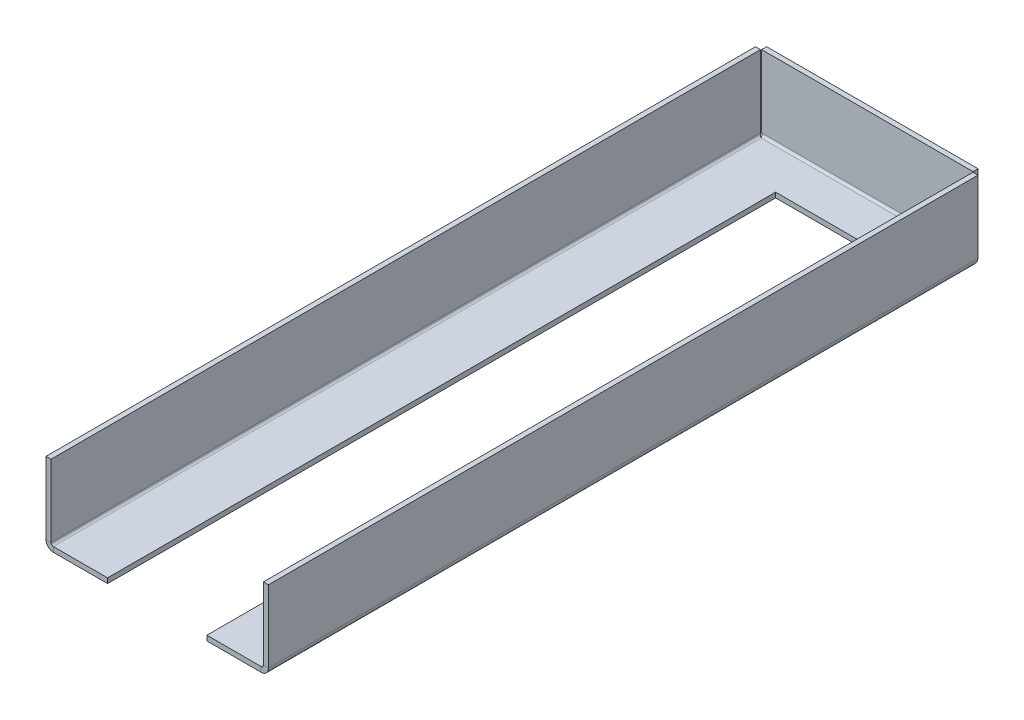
ISO-10303-21;
HEADER;
FILE_DESCRIPTION(('STEP AP214'),'2;1');
FILE_NAME('part.step','',(''),(''),'','','');
FILE_SCHEMA(('AUTOMOTIVE_DESIGN { 1 0 10303 214 1 1 1 1 }'));
ENDSEC;
DATA;
#1=APPLICATION_CONTEXT('core data for automotive mechanical design processes');
#2=APPLICATION_PROTOCOL_DEFINITION('international standard','automotive_design',2000,#1);
#3=PRODUCT_CONTEXT('',#1,'mechanical');
#4=PRODUCT('Part','Part','',(#3));
#5=PRODUCT_RELATED_PRODUCT_CATEGORY('part','',(#4));
#6=PRODUCT_DEFINITION_FORMATION('','',#4);
#7=PRODUCT_DEFINITION_CONTEXT('part definition',#1,'design');
#8=PRODUCT_DEFINITION('design','',#6,#7);
#9=PRODUCT_DEFINITION_SHAPE('','',#8);
#10=(LENGTH_UNIT() NAMED_UNIT(*) SI_UNIT(.MILLI.,.METRE.));
#11=(NAMED_UNIT(*) PLANE_ANGLE_UNIT() SI_UNIT($,.RADIAN.));
#12=(NAMED_UNIT(*) SI_UNIT($,.STERADIAN.) SOLID_ANGLE_UNIT());
#13=UNCERTAINTY_MEASURE_WITH_UNIT(LENGTH_MEASURE(1.E-05),#10,'distance_accuracy_value','');
#14=(GEOMETRIC_REPRESENTATION_CONTEXT(3) GLOBAL_UNCERTAINTY_ASSIGNED_CONTEXT((#13)) GLOBAL_UNIT_ASSIGNED_CONTEXT((#10,
#11,#12)) REPRESENTATION_CONTEXT('',''));
#15=CARTESIAN_POINT('',(0.,0.,0.));
#16=DIRECTION('',(0.,0.,1.));
#17=DIRECTION('',(1.,0.,0.));
#18=AXIS2_PLACEMENT_3D('',#15,#16,#17);
#19=CARTESIAN_POINT('',(-35.56,-1.6002,114.3));
#20=DIRECTION('',(0.,0.,1.));
#21=DIRECTION('',(1.,0.,0.));
#22=AXIS2_PLACEMENT_3D('',#19,#20,#21);
#23=PLANE('',#22);
#24=DIRECTION('',(0.,-1.,0.));
#25=VECTOR('',#24,1.);
#26=CARTESIAN_POINT('',(-15.875,-1.6002,114.3));
#27=LINE('',#26,#25);
#28=CARTESIAN_POINT('',(-15.875,0.,114.3));
#29=VERTEX_POINT('',#28);
#30=CARTESIAN_POINT('',(-15.875,-1.6002,114.3));
#31=VERTEX_POINT('',#30);
#32=EDGE_CURVE('E13',#29,#31,#27,.T.);
#33=ORIENTED_EDGE('',*,*,#32,.F.);
#34=DIRECTION('',(1.,0.,0.));
#35=VECTOR('',#34,1.);
#36=CARTESIAN_POINT('',(-35.56,0.,114.3));
#37=LINE('',#36,#35);
#38=CARTESIAN_POINT('',(-33.2232,0.,114.3));
#39=VERTEX_POINT('',#38);
#40=EDGE_CURVE('E250',#39,#29,#37,.T.);
#41=ORIENTED_EDGE('',*,*,#40,.F.);
#42=DIRECTION('',(0.,-1.,0.));
#43=VECTOR('',#42,1.);
#44=CARTESIAN_POINT('',(-33.2232,0.,114.3));
#45=LINE('',#44,#43);
#46=CARTESIAN_POINT('',(-33.2232,-1.6002,114.3));
#47=VERTEX_POINT('',#46);
#48=EDGE_CURVE('E743',#39,#47,#45,.T.);
#49=ORIENTED_EDGE('',*,*,#48,.T.);
#50=DIRECTION('',(1.,0.,0.));
#51=VECTOR('',#50,1.);
#52=CARTESIAN_POINT('',(-35.56,-1.6002,114.3));
#53=LINE('',#52,#51);
#54=EDGE_CURVE('E252',#47,#31,#53,.T.);
#55=ORIENTED_EDGE('',*,*,#54,.T.);
#56=EDGE_LOOP('',(#33,#41,#49,#55));
#57=FACE_BOUND('',#56,.T.);
#58=ADVANCED_FACE('F97',(#57),#23,.T.);
#59=CARTESIAN_POINT('',(0.,-1.6002,0.));
#60=DIRECTION('',(0.,-1.,0.));
#61=DIRECTION('',(0.,0.,-1.));
#62=AXIS2_PLACEMENT_3D('',#59,#60,#61);
#63=PLANE('',#62);
#64=DIRECTION('',(0.,0.,-1.));
#65=VECTOR('',#64,1.);
#66=CARTESIAN_POINT('',(-15.875,-1.6002,0.));
#67=LINE('',#66,#65);
#68=CARTESIAN_POINT('',(-15.875,-1.6002,-99.2632));
#69=VERTEX_POINT('',#68);
#70=EDGE_CURVE('E748',#31,#69,#67,.T.);
#71=ORIENTED_EDGE('',*,*,#70,.F.);
#72=ORIENTED_EDGE('',*,*,#54,.F.);
#73=DIRECTION('',(0.,0.,1.));
#74=VECTOR('',#73,1.);
#75=CARTESIAN_POINT('',(-33.2232,-1.6002,114.3));
#76=LINE('',#75,#74);
#77=CARTESIAN_POINT('',(-33.2232,-1.60020000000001,-111.9632));
#78=VERTEX_POINT('',#77);
#79=EDGE_CURVE('E319',#47,#78,#76,.F.);
#80=ORIENTED_EDGE('',*,*,#79,.T.);
#81=DIRECTION('',(-1.,0.,0.));
#82=VECTOR('',#81,1.);
#83=CARTESIAN_POINT('',(-33.7801948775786,-1.60020000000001,-111.9632));
#84=LINE('',#83,#82);
#85=CARTESIAN_POINT('',(33.2232,-1.6002,-111.9632));
#86=VERTEX_POINT('',#85);
#87=EDGE_CURVE('E792',#78,#86,#84,.F.);
#88=ORIENTED_EDGE('',*,*,#87,.T.);
#89=DIRECTION('',(0.,0.,-1.));
#90=VECTOR('',#89,1.);
#91=CARTESIAN_POINT('',(33.2232,-1.6002,-112.520194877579));
#92=LINE('',#91,#90);
#93=CARTESIAN_POINT('',(33.2232,-1.6002,114.3));
#94=VERTEX_POINT('',#93);
#95=EDGE_CURVE('E855',#86,#94,#92,.F.);
#96=ORIENTED_EDGE('',*,*,#95,.T.);
#97=CARTESIAN_POINT('',(15.875,-1.6002,114.3));
#98=VERTEX_POINT('',#97);
#99=EDGE_CURVE('E119',#98,#94,#53,.T.);
#100=ORIENTED_EDGE('',*,*,#99,.F.);
#101=DIRECTION('',(0.,0.,1.));
#102=VECTOR('',#101,1.);
#103=CARTESIAN_POINT('',(15.875,-1.6002,0.));
#104=LINE('',#103,#102);
#105=CARTESIAN_POINT('',(15.875,-1.6002,-99.2632));
#106=VERTEX_POINT('',#105);
#107=EDGE_CURVE('E112',#106,#98,#104,.T.);
#108=ORIENTED_EDGE('',*,*,#107,.F.);
#109=DIRECTION('',(1.,0.,0.));
#110=VECTOR('',#109,1.);
#111=CARTESIAN_POINT('',(0.,-1.6002,-99.2632));
#112=LINE('',#111,#110);
#113=EDGE_CURVE('E749',#69,#106,#112,.T.);
#114=ORIENTED_EDGE('',*,*,#113,.F.);
#115=EDGE_LOOP('',(#71,#72,#80,#88,#96,#100,#108,#114));
#116=FACE_BOUND('',#115,.T.);
#117=ADVANCED_FACE('F359',(#116),#63,.T.);
#118=CARTESIAN_POINT('',(0.,0.,0.));
#119=DIRECTION('',(0.,-1.,0.));
#120=DIRECTION('',(0.,0.,-1.));
#121=AXIS2_PLACEMENT_3D('',#118,#119,#120);
#122=PLANE('',#121);
#123=ORIENTED_EDGE('',*,*,#40,.T.);
#124=DIRECTION('',(0.,0.,1.));
#125=VECTOR('',#124,1.);
#126=CARTESIAN_POINT('',(-15.875,0.,-99.2632));
#127=LINE('',#126,#125);
#128=CARTESIAN_POINT('',(-15.875,0.,-99.2632));
#129=VERTEX_POINT('',#128);
#130=EDGE_CURVE('E234',#129,#29,#127,.T.);
#131=ORIENTED_EDGE('',*,*,#130,.F.);
#132=DIRECTION('',(-1.,0.,0.));
#133=VECTOR('',#132,1.);
#134=CARTESIAN_POINT('',(-15.875,0.,-99.2632));
#135=LINE('',#134,#133);
#136=CARTESIAN_POINT('',(15.875,0.,-99.2632));
#137=VERTEX_POINT('',#136);
#138=EDGE_CURVE('E269',#137,#129,#135,.T.);
#139=ORIENTED_EDGE('',*,*,#138,.F.);
#140=DIRECTION('',(0.,0.,-1.));
#141=VECTOR('',#140,1.);
#142=CARTESIAN_POINT('',(15.875,0.,-99.2632));
#143=LINE('',#142,#141);
#144=CARTESIAN_POINT('',(15.875,0.,114.3));
#145=VERTEX_POINT('',#144);
#146=EDGE_CURVE('E244',#145,#137,#143,.T.);
#147=ORIENTED_EDGE('',*,*,#146,.F.);
#148=CARTESIAN_POINT('',(33.2232,0.,114.3));
#149=VERTEX_POINT('',#148);
#150=EDGE_CURVE('E258',#145,#149,#37,.T.);
#151=ORIENTED_EDGE('',*,*,#150,.T.);
#152=DIRECTION('',(0.,0.,-1.));
#153=VECTOR('',#152,1.);
#154=CARTESIAN_POINT('',(33.2232,0.,-112.520194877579));
#155=LINE('',#154,#153);
#156=CARTESIAN_POINT('',(33.2232,0.,-111.9632));
#157=VERTEX_POINT('',#156);
#158=EDGE_CURVE('E287',#157,#149,#155,.F.);
#159=ORIENTED_EDGE('',*,*,#158,.F.);
#160=DIRECTION('',(-1.,0.,0.));
#161=VECTOR('',#160,1.);
#162=CARTESIAN_POINT('',(-33.7801948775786,0.,-111.9632));
#163=LINE('',#162,#161);
#164=CARTESIAN_POINT('',(-33.2232,0.,-111.9632));
#165=VERTEX_POINT('',#164);
#166=EDGE_CURVE('E785',#165,#157,#163,.F.);
#167=ORIENTED_EDGE('',*,*,#166,.F.);
#168=DIRECTION('',(0.,0.,1.));
#169=VECTOR('',#168,1.);
#170=CARTESIAN_POINT('',(-33.2232,0.,114.3));
#171=LINE('',#170,#169);
#172=EDGE_CURVE('E257',#39,#165,#171,.F.);
#173=ORIENTED_EDGE('',*,*,#172,.F.);
#174=EDGE_LOOP('',(#123,#131,#139,#147,#151,#159,#167,#173));
#175=FACE_BOUND('',#174,.T.);
#176=ADVANCED_FACE('F254',(#175),#122,.F.);
#177=DIRECTION('',(0.,1.,0.));
#178=VECTOR('',#177,1.);
#179=CARTESIAN_POINT('',(15.875,-1.6002,114.3));
#180=LINE('',#179,#178);
#181=EDGE_CURVE('E105',#98,#145,#180,.T.);
#182=ORIENTED_EDGE('',*,*,#181,.F.);
#183=ORIENTED_EDGE('',*,*,#99,.T.);
#184=DIRECTION('',(0.,-1.,0.));
#185=VECTOR('',#184,1.);
#186=CARTESIAN_POINT('',(33.2232,0.,114.3));
#187=LINE('',#186,#185);
#188=EDGE_CURVE('E272',#149,#94,#187,.T.);
#189=ORIENTED_EDGE('',*,*,#188,.F.);
#190=ORIENTED_EDGE('',*,*,#150,.F.);
#191=EDGE_LOOP('',(#182,#183,#189,#190));
#192=FACE_BOUND('',#191,.T.);
#193=ADVANCED_FACE('F99',(#192),#23,.T.);
#194=CARTESIAN_POINT('',(-33.2232,-1.616202,-111.9632));
#195=CARTESIAN_POINT('',(-33.5312353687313,-1.616202,-112.00962443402));
#196=CARTESIAN_POINT('',(-33.8390409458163,-1.55496486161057,-112.056032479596));
#197=CARTESIAN_POINT('',(-34.4081157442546,-1.31924636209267,-112.148864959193));
#198=CARTESIAN_POINT('',(-34.6691067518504,-1.14485774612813,-112.195281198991));
#199=CARTESIAN_POINT('',(-35.1046577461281,-0.709306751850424,-112.288113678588));
#200=CARTESIAN_POINT('',(-35.2790463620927,-0.448315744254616,-112.334529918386));
#201=CARTESIAN_POINT('',(-35.5147648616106,0.120759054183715,-112.427362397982));
#202=CARTESIAN_POINT('',(-35.576002,0.428564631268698,-112.473770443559));
#203=CARTESIAN_POINT('',(-35.576002,0.736599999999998,-112.520194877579));
#204=CARTESIAN_POINT('',(-33.2232,-1.6002,-111.9632));
#205=CARTESIAN_POINT('',(-33.5291403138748,-1.6002,-112.009624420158));
#206=CARTESIAN_POINT('',(-33.8348524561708,-1.53937935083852,-112.056032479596));
#207=CARTESIAN_POINT('',(-34.4000568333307,-1.30526403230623,-112.148864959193));
#208=CARTESIAN_POINT('',(-34.6592727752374,-1.13206147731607,-112.195281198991));
#209=CARTESIAN_POINT('',(-35.0918614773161,-0.699472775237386,-112.288113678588));
#210=CARTESIAN_POINT('',(-35.2650640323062,-0.44025683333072,-112.334529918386));
#211=CARTESIAN_POINT('',(-35.4991793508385,0.124947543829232,-112.427362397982));
#212=CARTESIAN_POINT('',(-35.56,0.430659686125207,-112.47377045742));
#213=CARTESIAN_POINT('',(-35.56,0.736599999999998,-112.520194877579));
#214=CARTESIAN_POINT('',(-33.2232,0.,-111.9632));
#215=CARTESIAN_POINT('',(-33.3196348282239,0.,-112.009623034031));
#216=CARTESIAN_POINT('',(-33.4160034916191,0.0191717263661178,-112.056032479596));
#217=CARTESIAN_POINT('',(-33.5941657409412,0.0929689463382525,-112.148864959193));
#218=CARTESIAN_POINT('',(-33.6758751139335,0.147565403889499,-112.195281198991));
#219=CARTESIAN_POINT('',(-33.8122345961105,0.283924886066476,-112.288113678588));
#220=CARTESIAN_POINT('',(-33.8668310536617,0.365634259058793,-112.334529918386));
#221=CARTESIAN_POINT('',(-33.9406282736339,0.543796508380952,-112.427362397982));
#222=CARTESIAN_POINT('',(-33.9598,0.640165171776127,-112.473771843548));
#223=CARTESIAN_POINT('',(-33.9598,0.736599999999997,-112.520194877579));
#224=CARTESIAN_POINT('',(-33.2232,0.0161620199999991,-111.9632));
#225=CARTESIAN_POINT('',(-33.3175188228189,0.0161620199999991,-112.009623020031));
#226=CARTESIAN_POINT('',(-33.4117731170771,0.0349130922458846,-112.056032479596));
#227=CARTESIAN_POINT('',(-33.5860262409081,0.107091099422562,-112.148864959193));
#228=CARTESIAN_POINT('',(-33.6659427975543,0.160489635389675,-112.195281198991));
#229=CARTESIAN_POINT('',(-33.7993103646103,0.293857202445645,-112.288113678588));
#230=CARTESIAN_POINT('',(-33.8527089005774,0.373773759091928,-112.334529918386));
#231=CARTESIAN_POINT('',(-33.9248869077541,0.548026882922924,-112.427362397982));
#232=CARTESIAN_POINT('',(-33.94363798,0.642281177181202,-112.473771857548));
#233=CARTESIAN_POINT('',(-33.94363798,0.736599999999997,-112.520194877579));
#234=B_SPLINE_SURFACE_WITH_KNOTS('',1,3,((#194,#195,#196,#197,#198,#199,#200,#201,#202,#203),
(#204,#205,#206,#207,#208,#209,#210,#211,#212,#213),(#214,#215,#216,#217,#218,#219,#220,#221,
#222,#223),(#224,#225,#226,#227,#228,#229,#230,#231,#232,#233)),.UNSPECIFIED.,.F.,.F.,.F.,(2,1,
1,2),(4,2,2,2,4),(-0.01,0.,1.,1.0101),(0.,0.25,0.5,0.75,1.),.UNSPECIFIED.);
#235=DIRECTION('',(1.,0.,0.));
#236=VECTOR('',#235,1.);
#237=CARTESIAN_POINT('',(-33.9598,0.736599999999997,-112.520194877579));
#238=LINE('',#237,#236);
#239=CARTESIAN_POINT('',(-35.56,0.736599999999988,-112.520194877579));
#240=VERTEX_POINT('',#239);
#241=CARTESIAN_POINT('',(-33.9598,0.736599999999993,-112.520194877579));
#242=VERTEX_POINT('',#241);
#243=EDGE_CURVE('E290',#240,#242,#238,.T.);
#244=CARTESIAN_POINT('',(-33.2232,0.,-111.9632));
#245=CARTESIAN_POINT('',(-33.235252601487,-2.55665593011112E-07,-111.969002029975));
#246=CARTESIAN_POINT('',(-33.2473051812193,0.000295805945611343,-111.97480405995));
#247=CARTESIAN_POINT('',(-33.2713813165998,0.00147872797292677,-111.986408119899));
#248=CARTESIAN_POINT('',(-33.2834048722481,0.00236558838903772,-111.992210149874));
#249=CARTESIAN_POINT('',(-33.3073939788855,0.00472827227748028,-112.003814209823));
#250=CARTESIAN_POINT('',(-33.3193595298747,0.00620409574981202,-112.009616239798));
#251=CARTESIAN_POINT('',(-33.343203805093,0.00974106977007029,-112.021220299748));
#252=CARTESIAN_POINT('',(-33.3550825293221,0.0118022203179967,-112.027022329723));
#253=CARTESIAN_POINT('',(-33.3787245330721,0.0165049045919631,-112.038626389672));
#254=CARTESIAN_POINT('',(-33.3904878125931,0.0191464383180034,-112.044428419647));
#255=CARTESIAN_POINT('',(-33.4138705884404,0.0250035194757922,-112.056032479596));
#256=CARTESIAN_POINT('',(-33.4254900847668,0.0282190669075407,-112.061834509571));
#257=CARTESIAN_POINT('',(-33.4485573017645,0.0352164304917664,-112.073438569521));
#258=CARTESIAN_POINT('',(-33.4600050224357,0.0389982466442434,-112.079240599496));
#259=CARTESIAN_POINT('',(-33.4827011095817,0.0471190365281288,-112.090844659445));
#260=CARTESIAN_POINT('',(-33.4939494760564,0.0514580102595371,-112.09664668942));
#261=CARTESIAN_POINT('',(-33.5162197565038,0.0606826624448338,-112.108250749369));
#262=CARTESIAN_POINT('',(-33.5272416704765,0.0655683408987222,-112.114052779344));
#263=CARTESIAN_POINT('',(-33.549032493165,0.0758746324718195,-112.125656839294));
#264=CARTESIAN_POINT('',(-33.5598014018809,0.0812952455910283,-112.131458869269));
#265=CARTESIAN_POINT('',(-33.5810602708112,0.0926583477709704,-112.143062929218));
#266=CARTESIAN_POINT('',(-33.5915502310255,0.0986008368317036,-112.148864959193));
#267=CARTESIAN_POINT('',(-33.6122259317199,0.110993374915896,-112.160469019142));
#268=CARTESIAN_POINT('',(-33.6224116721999,0.117443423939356,-112.166271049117));
#269=CARTESIAN_POINT('',(-33.6424543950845,0.13083554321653,-112.177875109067));
#270=CARTESIAN_POINT('',(-33.6523113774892,0.137777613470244,-112.183677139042));
#271=CARTESIAN_POINT('',(-33.6716728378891,0.15213705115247,-112.195281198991));
#272=CARTESIAN_POINT('',(-33.6811773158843,0.159554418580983,-112.201083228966));
#273=CARTESIAN_POINT('',(-33.6998108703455,0.17484658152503,-112.212687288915));
#274=CARTESIAN_POINT('',(-33.7089399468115,0.182721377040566,-112.21848931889));
#275=CARTESIAN_POINT('',(-33.7268007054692,0.198909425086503,-112.23009337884));
#276=CARTESIAN_POINT('',(-33.7355323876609,0.207222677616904,-112.235895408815));
#277=CARTESIAN_POINT('',(-33.7525773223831,0.224267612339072,-112.247499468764));
#278=CARTESIAN_POINT('',(-33.7608905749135,0.232999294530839,-112.253301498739));
#279=CARTESIAN_POINT('',(-33.7770786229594,0.250860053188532,-112.264905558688));
#280=CARTESIAN_POINT('',(-33.784953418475,0.25998912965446,-112.270707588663));
#281=CARTESIAN_POINT('',(-33.800245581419,0.278622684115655,-112.282311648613));
#282=CARTESIAN_POINT('',(-33.8076629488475,0.288127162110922,-112.288113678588));
#283=CARTESIAN_POINT('',(-33.8220223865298,0.307488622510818,-112.299717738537));
#284=CARTESIAN_POINT('',(-33.8289644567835,0.317345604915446,-112.305519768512));
#285=CARTESIAN_POINT('',(-33.8423565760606,0.337388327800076,-112.317123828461));
#286=CARTESIAN_POINT('',(-33.8488066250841,0.347574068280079,-112.322925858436));
#287=CARTESIAN_POINT('',(-33.8611991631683,0.36824976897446,-112.334529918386));
#288=CARTESIAN_POINT('',(-33.867141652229,0.378739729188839,-112.34033194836));
#289=CARTESIAN_POINT('',(-33.878504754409,0.3999985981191,-112.35193600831));
#290=CARTESIAN_POINT('',(-33.8839253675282,0.410767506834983,-112.357738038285));
#291=CARTESIAN_POINT('',(-33.8942316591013,0.432558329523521,-112.369342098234));
#292=CARTESIAN_POINT('',(-33.8991173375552,0.443580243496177,-112.375144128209));
#293=CARTESIAN_POINT('',(-33.9083419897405,0.465850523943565,-112.386748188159));
#294=CARTESIAN_POINT('',(-33.9126809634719,0.477098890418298,-112.392550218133));
#295=CARTESIAN_POINT('',(-33.9208017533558,0.499794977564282,-112.404154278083));
#296=CARTESIAN_POINT('',(-33.9245835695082,0.511242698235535,-112.409956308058));
#297=CARTESIAN_POINT('',(-33.9315809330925,0.534309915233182,-112.421560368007));
#298=CARTESIAN_POINT('',(-33.9347964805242,0.545929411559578,-112.427362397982));
#299=CARTESIAN_POINT('',(-33.940653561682,0.569312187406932,-112.438966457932));
#300=CARTESIAN_POINT('',(-33.943295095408,0.581075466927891,-112.444768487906));
#301=CARTESIAN_POINT('',(-33.947997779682,0.60471747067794,-112.456372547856));
#302=CARTESIAN_POINT('',(-33.9500589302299,0.616596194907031,-112.462174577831));
#303=CARTESIAN_POINT('',(-33.9535959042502,0.640440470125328,-112.47377863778));
#304=CARTESIAN_POINT('',(-33.9550717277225,0.652406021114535,-112.479580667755));
#305=CARTESIAN_POINT('',(-33.957434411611,0.676395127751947,-112.491184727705));
#306=CARTESIAN_POINT('',(-33.9583212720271,0.688418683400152,-112.496986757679));
#307=CARTESIAN_POINT('',(-33.9595041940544,0.712494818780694,-112.508590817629));
#308=CARTESIAN_POINT('',(-33.9598002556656,0.724547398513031,-112.514392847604));
#309=CARTESIAN_POINT('',(-33.9598,0.736599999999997,-112.520194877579));
#310=B_SPLINE_CURVE_WITH_KNOTS('',3,(#244,#245,#246,#247,#248,#249,#250,#251,#252,#253,#254,
#255,#256,#257,#258,#259,#260,#261,#262,#263,#264,#265,#266,#267,#268,#269,#270,#271,#272,#273,
#274,#275,#276,#277,#278,#279,#280,#281,#282,#283,#284,#285,#286,#287,#288,#289,#290,#291,#292,
#293,#294,#295,#296,#297,#298,#299,#300,#301,#302,#303,#304,#305,#306,#307,#308,#309),
.UNSPECIFIED.,.F.,.F.,(4,2,2,2,2,2,2,2,2,2,2,2,2,2,2,2,2,2,2,2,2,2,2,2,2,2,2,2,2,2,2,2,4),(0.,
0.0401259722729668,0.0802519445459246,0.12037791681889,0.160503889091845,0.200629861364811,
0.240755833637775,0.28088180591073,0.321007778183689,0.361133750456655,0.401259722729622,
0.441385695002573,0.481511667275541,0.521637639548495,0.561763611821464,0.60188958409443,
0.642015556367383,0.682141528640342,0.722267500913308,0.762393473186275,0.802519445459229,
0.842645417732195,0.88277139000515,0.922897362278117,0.963023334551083,1.00314930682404,
1.04327527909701,1.08340125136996,1.12352722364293,1.16365319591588,1.20377916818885,
1.2439051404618,1.28403111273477),.UNSPECIFIED.);
#311=EDGE_CURVE('E320',#165,#242,#310,.T.);
#312=DIRECTION('',(0.,-1.,0.));
#313=VECTOR('',#312,1.);
#314=CARTESIAN_POINT('',(-33.2232,0.,-111.9632));
#315=LINE('',#314,#313);
#316=EDGE_CURVE('E261',#165,#78,#315,.T.);
#317=CARTESIAN_POINT('',(-33.2232,-1.6002,-111.9632));
#318=CARTESIAN_POINT('',(-33.2614358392,-1.60020081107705,-111.969002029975));
#319=CARTESIAN_POINT('',(-33.2996716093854,-1.59926158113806,-111.97480405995));
#320=CARTESIAN_POINT('',(-33.3760510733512,-1.59550886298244,-111.986408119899));
#321=CARTESIAN_POINT('',(-33.4141947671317,-1.59269537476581,-111.992210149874));
#322=CARTESIAN_POINT('',(-33.4902981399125,-1.58519996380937,-112.003814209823));
#323=CARTESIAN_POINT('',(-33.5282578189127,-1.58051804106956,-112.009616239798));
#324=CARTESIAN_POINT('',(-33.6039017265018,-1.56929729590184,-112.021220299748));
#325=CARTESIAN_POINT('',(-33.6415859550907,-1.56275847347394,-112.027022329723));
#326=CARTESIAN_POINT('',(-33.7165881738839,-1.5478396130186,-112.038626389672));
#327=CARTESIAN_POINT('',(-33.7539061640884,-1.53945957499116,-112.044428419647));
#328=CARTESIAN_POINT('',(-33.8280860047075,-1.52087848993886,-112.056032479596));
#329=CARTESIAN_POINT('',(-33.8649478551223,-1.51067744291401,-112.061834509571));
#330=CARTESIAN_POINT('',(-33.9381266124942,-1.48847891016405,-112.073438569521));
#331=CARTESIAN_POINT('',(-33.9744435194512,-1.47648142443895,-112.079240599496));
#332=CARTESIAN_POINT('',(-34.0464448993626,-1.45071891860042,-112.090844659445));
#333=CARTESIAN_POINT('',(-34.082129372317,-1.43695389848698,-112.09664668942));
#334=CARTESIAN_POINT('',(-34.1527799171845,-1.40768948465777,-112.108250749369));
#335=CARTESIAN_POINT('',(-34.1877459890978,-1.39219009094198,-112.114052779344));
#336=CARTESIAN_POINT('',(-34.256875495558,-1.35949426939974,-112.125656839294));
#337=CARTESIAN_POINT('',(-34.2910389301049,-1.34229784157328,-112.131458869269));
#338=CARTESIAN_POINT('',(-34.3584808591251,-1.30624937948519,-112.143062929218));
#339=CARTESIAN_POINT('',(-34.3917593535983,-1.28739734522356,-112.148864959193));
#340=CARTESIAN_POINT('',(-34.4573512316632,-1.24808308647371,-112.160469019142));
#341=CARTESIAN_POINT('',(-34.4896646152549,-1.22762086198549,-112.166271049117));
#342=CARTESIAN_POINT('',(-34.5532484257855,-1.18513551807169,-112.177875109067));
#343=CARTESIAN_POINT('',(-34.5845188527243,-1.16311239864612,-112.183677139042));
#344=CARTESIAN_POINT('',(-34.6459414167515,-1.11755832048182,-112.195281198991));
#345=CARTESIAN_POINT('',(-34.67609355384,-1.09402736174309,-112.201083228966));
#346=CARTESIAN_POINT('',(-34.7352068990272,-1.045514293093,-112.212687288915));
#347=CARTESIAN_POINT('',(-34.764168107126,-1.02053218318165,-112.21848931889));
#348=CARTESIAN_POINT('',(-34.820829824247,-0.969176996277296,-112.23009337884));
#349=CARTESIAN_POINT('',(-34.8485303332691,-0.9428039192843,-112.235895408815));
#350=CARTESIAN_POINT('',(-34.9026039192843,-0.888730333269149,-112.247499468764));
#351=CARTESIAN_POINT('',(-34.9289769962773,-0.861029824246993,-112.253301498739));
#352=CARTESIAN_POINT('',(-34.9803321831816,-0.804368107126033,-112.264905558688));
#353=CARTESIAN_POINT('',(-35.005314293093,-0.77540689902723,-112.270707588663));
#354=CARTESIAN_POINT('',(-35.0538273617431,-0.716293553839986,-112.282311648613));
#355=CARTESIAN_POINT('',(-35.0773583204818,-0.686141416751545,-112.288113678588));
#356=CARTESIAN_POINT('',(-35.1229123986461,-0.624718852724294,-112.299717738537));
#357=CARTESIAN_POINT('',(-35.1449355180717,-0.593448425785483,-112.305519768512));
#358=CARTESIAN_POINT('',(-35.1874208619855,-0.529864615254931,-112.317123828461));
#359=CARTESIAN_POINT('',(-35.2078830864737,-0.497551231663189,-112.322925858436));
#360=CARTESIAN_POINT('',(-35.2471973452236,-0.431959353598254,-112.334529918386));
#361=CARTESIAN_POINT('',(-35.2660493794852,-0.39868085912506,-112.34033194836));
#362=CARTESIAN_POINT('',(-35.3020978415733,-0.331238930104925,-112.35193600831));
#363=CARTESIAN_POINT('',(-35.3192942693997,-0.297075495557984,-112.357738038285));
#364=CARTESIAN_POINT('',(-35.351990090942,-0.227945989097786,-112.369342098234));
#365=CARTESIAN_POINT('',(-35.3674894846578,-0.192979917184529,-112.375144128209));
#366=CARTESIAN_POINT('',(-35.396753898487,-0.122329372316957,-112.386748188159));
#367=CARTESIAN_POINT('',(-35.4105189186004,-0.0866448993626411,-112.392550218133));
#368=CARTESIAN_POINT('',(-35.436281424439,-0.0146435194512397,-112.404154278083));
#369=CARTESIAN_POINT('',(-35.448278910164,0.021673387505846,-112.409956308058));
#370=CARTESIAN_POINT('',(-35.470477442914,0.094852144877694,-112.421560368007));
#371=CARTESIAN_POINT('',(-35.4806784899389,0.131713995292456,-112.427362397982));
#372=CARTESIAN_POINT('',(-35.4992595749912,0.205893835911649,-112.438966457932));
#373=CARTESIAN_POINT('',(-35.5076396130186,0.243211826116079,-112.444768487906));
#374=CARTESIAN_POINT('',(-35.5225584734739,0.318214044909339,-112.456372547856));
#375=CARTESIAN_POINT('',(-35.5290972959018,0.355898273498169,-112.462174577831));
#376=CARTESIAN_POINT('',(-35.5403180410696,0.431542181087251,-112.47377863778));
#377=CARTESIAN_POINT('',(-35.5449999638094,0.469501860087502,-112.479580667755));
#378=CARTESIAN_POINT('',(-35.5524953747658,0.545605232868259,-112.491184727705));
#379=CARTESIAN_POINT('',(-35.5553088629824,0.583748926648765,-112.496986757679));
#380=CARTESIAN_POINT('',(-35.5590615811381,0.660128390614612,-112.508590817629));
#381=CARTESIAN_POINT('',(-35.560000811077,0.698364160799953,-112.514392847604));
#382=CARTESIAN_POINT('',(-35.56,0.736599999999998,-112.520194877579));
#383=B_SPLINE_CURVE_WITH_KNOTS('',3,(#317,#318,#319,#320,#321,#322,#323,#324,#325,#326,#327,
#328,#329,#330,#331,#332,#333,#334,#335,#336,#337,#338,#339,#340,#341,#342,#343,#344,#345,#346,
#347,#348,#349,#350,#351,#352,#353,#354,#355,#356,#357,#358,#359,#360,#361,#362,#363,#364,#365,
#366,#367,#368,#369,#370,#371,#372,#373,#374,#375,#376,#377,#378,#379,#380,#381,#382),
.UNSPECIFIED.,.F.,.F.,(4,2,2,2,2,2,2,2,2,2,2,2,2,2,2,2,2,2,2,2,2,2,2,2,2,2,2,2,2,2,2,2,4),(0.,
0.116009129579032,0.232018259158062,0.348027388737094,0.464036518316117,0.580045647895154,
0.696054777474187,0.812063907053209,0.928073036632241,1.04408216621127,1.1600912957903,
1.27610042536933,1.39210955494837,1.50811868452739,1.62412781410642,1.74013694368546,
1.85614607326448,1.97215520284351,2.08816433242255,2.20417346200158,2.3201825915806,
2.43619172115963,2.55220085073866,2.6682099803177,2.78421910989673,2.90022823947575,
3.01623736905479,3.13224649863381,3.24825562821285,3.36426475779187,3.48027388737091,
3.59628301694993,3.71229214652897),.UNSPECIFIED.);
#384=EDGE_CURVE('E739',#78,#240,#383,.T.);
#385=ORIENTED_EDGE('',*,*,#243,.T.);
#386=ORIENTED_EDGE('',*,*,#311,.F.);
#387=ORIENTED_EDGE('',*,*,#316,.T.);
#388=ORIENTED_EDGE('',*,*,#384,.T.);
#389=EDGE_LOOP('',(#385,#386,#387,#388));
#390=FACE_BOUND('',#389,.T.);
#391=ADVANCED_FACE('F344',(#390),#234,.F.);
#392=CARTESIAN_POINT('',(-33.2232,0.736599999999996,114.3));
#393=DIRECTION('',(0.,0.,-1.));
#394=DIRECTION('',(-1.,0.,0.));
#395=AXIS2_PLACEMENT_3D('',#392,#393,#394);
#396=PLANE('',#395);
#397=CARTESIAN_POINT('',(-33.2232,0.736599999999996,114.3));
#398=DIRECTION('',(0.,0.,1.));
#399=DIRECTION('',(1.,0.,0.));
#400=AXIS2_PLACEMENT_3D('',#397,#398,#399);
#401=CIRCLE('',#400,0.736599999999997);
#402=CARTESIAN_POINT('',(-33.9598,0.736599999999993,114.3));
#403=VERTEX_POINT('',#402);
#404=EDGE_CURVE('E292',#403,#39,#401,.T.);
#405=ORIENTED_EDGE('',*,*,#404,.F.);
#406=DIRECTION('',(1.,0.,0.));
#407=VECTOR('',#406,1.);
#408=CARTESIAN_POINT('',(-33.9598,0.73659999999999,114.3));
#409=LINE('',#408,#407);
#410=CARTESIAN_POINT('',(-35.56,0.736599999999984,114.3));
#411=VERTEX_POINT('',#410);
#412=EDGE_CURVE('E308',#403,#411,#409,.F.);
#413=ORIENTED_EDGE('',*,*,#412,.T.);
#414=CARTESIAN_POINT('',(-33.2232,0.736599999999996,114.3));
#415=DIRECTION('',(0.,0.,1.));
#416=DIRECTION('',(1.,0.,0.));
#417=AXIS2_PLACEMENT_3D('',#414,#415,#416);
#418=CIRCLE('',#417,2.3368);
#419=EDGE_CURVE('E316',#411,#47,#418,.T.);
#420=ORIENTED_EDGE('',*,*,#419,.T.);
#421=ORIENTED_EDGE('',*,*,#48,.F.);
#422=EDGE_LOOP('',(#405,#413,#420,#421));
#423=FACE_BOUND('',#422,.T.);
#424=ADVANCED_FACE('F349',(#423),#396,.F.);
#425=CARTESIAN_POINT('',(-33.2232,0.736599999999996,114.3));
#426=DIRECTION('',(0.,0.,1.));
#427=DIRECTION('',(-1.,0.,0.));
#428=AXIS2_PLACEMENT_3D('',#425,#426,#427);
#429=CYLINDRICAL_SURFACE('',#428,2.3368);
#430=ORIENTED_EDGE('',*,*,#79,.F.);
#431=ORIENTED_EDGE('',*,*,#419,.F.);
#432=DIRECTION('',(0.,0.,1.));
#433=VECTOR('',#432,1.);
#434=CARTESIAN_POINT('',(-35.56,0.736599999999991,-114.3));
#435=LINE('',#434,#433);
#436=EDGE_CURVE('E306',#411,#240,#435,.F.);
#437=ORIENTED_EDGE('',*,*,#436,.T.);
#438=ORIENTED_EDGE('',*,*,#384,.F.);
#439=EDGE_LOOP('',(#430,#431,#437,#438));
#440=FACE_BOUND('',#439,.T.);
#441=ADVANCED_FACE('F340',(#440),#429,.T.);
#442=CARTESIAN_POINT('',(-33.2232,0.736599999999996,114.3));
#443=DIRECTION('',(0.,0.,1.));
#444=DIRECTION('',(-1.,0.,0.));
#445=AXIS2_PLACEMENT_3D('',#442,#443,#444);
#446=CYLINDRICAL_SURFACE('',#445,0.736599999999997);
#447=ORIENTED_EDGE('',*,*,#172,.T.);
#448=ORIENTED_EDGE('',*,*,#311,.T.);
#449=DIRECTION('',(0.,0.,1.));
#450=VECTOR('',#449,1.);
#451=CARTESIAN_POINT('',(-33.9598,0.736599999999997,-114.3));
#452=LINE('',#451,#450);
#453=EDGE_CURVE('E311',#242,#403,#452,.T.);
#454=ORIENTED_EDGE('',*,*,#453,.T.);
#455=ORIENTED_EDGE('',*,*,#404,.T.);
#456=EDGE_LOOP('',(#447,#448,#454,#455));
#457=FACE_BOUND('',#456,.T.);
#458=ADVANCED_FACE('F329',(#457),#446,.F.);
#459=CARTESIAN_POINT('',(-33.9598,0.,-112.520194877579));
#460=DIRECTION('',(0.,0.,-1.));
#461=DIRECTION('',(0.,1.,0.));
#462=AXIS2_PLACEMENT_3D('',#459,#460,#461);
#463=PLANE('',#462);
#464=DIRECTION('',(0.,-1.,0.));
#465=VECTOR('',#464,1.);
#466=CARTESIAN_POINT('',(-35.56,0.,-112.520194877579));
#467=LINE('',#466,#465);
#468=CARTESIAN_POINT('',(-35.5600000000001,23.7998,-112.520194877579));
#469=VERTEX_POINT('',#468);
#470=EDGE_CURVE('E281',#240,#469,#467,.F.);
#471=ORIENTED_EDGE('',*,*,#470,.T.);
#472=DIRECTION('',(-1.,0.,0.));
#473=VECTOR('',#472,1.);
#474=CARTESIAN_POINT('',(-33.9598000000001,23.7998,-112.520194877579));
#475=LINE('',#474,#473);
#476=CARTESIAN_POINT('',(-33.9598000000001,23.7998,-112.520194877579));
#477=VERTEX_POINT('',#476);
#478=EDGE_CURVE('E313',#469,#477,#475,.F.);
#479=ORIENTED_EDGE('',*,*,#478,.T.);
#480=DIRECTION('',(0.,1.,0.));
#481=VECTOR('',#480,1.);
#482=CARTESIAN_POINT('',(-33.9598,-1.17521456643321E-13,-112.520194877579));
#483=LINE('',#482,#481);
#484=EDGE_CURVE('E277',#242,#477,#483,.T.);
#485=ORIENTED_EDGE('',*,*,#484,.F.);
#486=ORIENTED_EDGE('',*,*,#243,.F.);
#487=EDGE_LOOP('',(#471,#479,#485,#486));
#488=FACE_BOUND('',#487,.T.);
#489=ADVANCED_FACE('F339',(#488),#463,.T.);
#490=CARTESIAN_POINT('',(-35.56,-1.29998399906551E-13,0.));
#491=DIRECTION('',(1.,0.,0.));
#492=DIRECTION('',(0.,1.,0.));
#493=AXIS2_PLACEMENT_3D('',#490,#491,#492);
#494=PLANE('',#493);
#495=ORIENTED_EDGE('',*,*,#470,.F.);
#496=ORIENTED_EDGE('',*,*,#436,.F.);
#497=DIRECTION('',(0.,1.,0.));
#498=VECTOR('',#497,1.);
#499=CARTESIAN_POINT('',(-35.56,0.,114.3));
#500=LINE('',#499,#498);
#501=CARTESIAN_POINT('',(-35.5600000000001,23.7998,114.3));
#502=VERTEX_POINT('',#501);
#503=EDGE_CURVE('E299',#411,#502,#500,.T.);
#504=ORIENTED_EDGE('',*,*,#503,.T.);
#505=DIRECTION('',(0.,0.,-1.));
#506=VECTOR('',#505,1.);
#507=CARTESIAN_POINT('',(-35.5600000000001,23.7998,0.));
#508=LINE('',#507,#506);
#509=EDGE_CURVE('E296',#502,#469,#508,.T.);
#510=ORIENTED_EDGE('',*,*,#509,.T.);
#511=EDGE_LOOP('',(#495,#496,#504,#510));
#512=FACE_BOUND('',#511,.T.);
#513=ADVANCED_FACE('F628',(#512),#494,.F.);
#514=CARTESIAN_POINT('',(-33.9598,-1.24411331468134E-13,0.));
#515=DIRECTION('',(1.,0.,0.));
#516=DIRECTION('',(0.,1.,0.));
#517=AXIS2_PLACEMENT_3D('',#514,#515,#516);
#518=PLANE('',#517);
#519=ORIENTED_EDGE('',*,*,#453,.F.);
#520=ORIENTED_EDGE('',*,*,#484,.T.);
#521=DIRECTION('',(0.,0.,1.));
#522=VECTOR('',#521,1.);
#523=CARTESIAN_POINT('',(-33.9598000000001,23.7998,-114.3));
#524=LINE('',#523,#522);
#525=CARTESIAN_POINT('',(-33.9598000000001,23.7998,114.3));
#526=VERTEX_POINT('',#525);
#527=EDGE_CURVE('E301',#526,#477,#524,.F.);
#528=ORIENTED_EDGE('',*,*,#527,.F.);
#529=DIRECTION('',(0.,-1.,0.));
#530=VECTOR('',#529,1.);
#531=CARTESIAN_POINT('',(-33.9598000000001,23.7998,114.3));
#532=LINE('',#531,#530);
#533=EDGE_CURVE('E304',#403,#526,#532,.F.);
#534=ORIENTED_EDGE('',*,*,#533,.F.);
#535=EDGE_LOOP('',(#519,#520,#528,#534));
#536=FACE_BOUND('',#535,.T.);
#537=ADVANCED_FACE('F618',(#536),#518,.T.);
#538=CARTESIAN_POINT('',(-35.5600000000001,23.7998,-114.3));
#539=DIRECTION('',(0.,-1.,0.));
#540=DIRECTION('',(1.,0.,0.));
#541=AXIS2_PLACEMENT_3D('',#538,#539,#540);
#542=PLANE('',#541);
#543=ORIENTED_EDGE('',*,*,#478,.F.);
#544=ORIENTED_EDGE('',*,*,#509,.F.);
#545=DIRECTION('',(1.,0.,0.));
#546=VECTOR('',#545,1.);
#547=CARTESIAN_POINT('',(-35.5600000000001,23.7998,114.3));
#548=LINE('',#547,#546);
#549=EDGE_CURVE('E293',#502,#526,#548,.T.);
#550=ORIENTED_EDGE('',*,*,#549,.T.);
#551=ORIENTED_EDGE('',*,*,#527,.T.);
#552=EDGE_LOOP('',(#543,#544,#550,#551));
#553=FACE_BOUND('',#552,.T.);
#554=ADVANCED_FACE('F609',(#553),#542,.F.);
#555=CARTESIAN_POINT('',(-35.5600000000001,23.7998,114.3));
#556=DIRECTION('',(0.,0.,-1.));
#557=DIRECTION('',(0.,1.,0.));
#558=AXIS2_PLACEMENT_3D('',#555,#556,#557);
#559=PLANE('',#558);
#560=ORIENTED_EDGE('',*,*,#412,.F.);
#561=ORIENTED_EDGE('',*,*,#533,.T.);
#562=ORIENTED_EDGE('',*,*,#549,.F.);
#563=ORIENTED_EDGE('',*,*,#503,.F.);
#564=EDGE_LOOP('',(#560,#561,#562,#563));
#565=FACE_BOUND('',#564,.T.);
#566=ADVANCED_FACE('F600',(#565),#559,.F.);
#567=CARTESIAN_POINT('',(33.2232,0.736599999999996,114.3));
#568=DIRECTION('',(0.,0.,1.));
#569=DIRECTION('',(1.,0.,0.));
#570=AXIS2_PLACEMENT_3D('',#567,#568,#569);
#571=PLANE('',#570);
#572=DIRECTION('',(-1.,0.,0.));
#573=VECTOR('',#572,1.);
#574=CARTESIAN_POINT('',(35.56,0.736599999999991,114.3));
#575=LINE('',#574,#573);
#576=CARTESIAN_POINT('',(33.9598,0.736599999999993,114.3));
#577=VERTEX_POINT('',#576);
#578=CARTESIAN_POINT('',(35.56,0.736599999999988,114.3));
#579=VERTEX_POINT('',#578);
#580=EDGE_CURVE('E844',#577,#579,#575,.F.);
#581=ORIENTED_EDGE('',*,*,#580,.F.);
#582=CARTESIAN_POINT('',(33.2232,0.736599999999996,114.3));
#583=DIRECTION('',(0.,0.,-1.));
#584=DIRECTION('',(-1.,0.,0.));
#585=AXIS2_PLACEMENT_3D('',#582,#583,#584);
#586=CIRCLE('',#585,0.736599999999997);
#587=EDGE_CURVE('E856',#149,#577,#586,.F.);
#588=ORIENTED_EDGE('',*,*,#587,.F.);
#589=ORIENTED_EDGE('',*,*,#188,.T.);
#590=CARTESIAN_POINT('',(33.2232,0.736599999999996,114.3));
#591=DIRECTION('',(0.,0.,-1.));
#592=DIRECTION('',(-1.,0.,0.));
#593=AXIS2_PLACEMENT_3D('',#590,#591,#592);
#594=CIRCLE('',#593,2.3368);
#595=EDGE_CURVE('E284',#94,#579,#594,.F.);
#596=ORIENTED_EDGE('',*,*,#595,.T.);
#597=EDGE_LOOP('',(#581,#588,#589,#596));
#598=FACE_BOUND('',#597,.T.);
#599=ADVANCED_FACE('F590',(#598),#571,.T.);
#600=CARTESIAN_POINT('',(35.576002,0.736599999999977,-112.520194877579));
#601=CARTESIAN_POINT('',(35.576002,0.428564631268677,-112.473770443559));
#602=CARTESIAN_POINT('',(35.5147648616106,0.120759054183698,-112.427362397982));
#603=CARTESIAN_POINT('',(35.2790463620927,-0.448315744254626,-112.334529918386));
#604=CARTESIAN_POINT('',(35.1046577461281,-0.709306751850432,-112.288113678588));
#605=CARTESIAN_POINT('',(34.6691067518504,-1.14485774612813,-112.195281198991));
#606=CARTESIAN_POINT('',(34.4081157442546,-1.31924636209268,-112.148864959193));
#607=CARTESIAN_POINT('',(33.8390409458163,-1.55496486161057,-112.056032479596));
#608=CARTESIAN_POINT('',(33.5312353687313,-1.616202,-112.00962443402));
#609=CARTESIAN_POINT('',(33.2232,-1.616202,-111.9632));
#610=CARTESIAN_POINT('',(35.56,0.736599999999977,-112.520194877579));
#611=CARTESIAN_POINT('',(35.56,0.430659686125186,-112.47377045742));
#612=CARTESIAN_POINT('',(35.4991793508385,0.124947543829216,-112.427362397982));
#613=CARTESIAN_POINT('',(35.2650640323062,-0.440256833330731,-112.334529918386));
#614=CARTESIAN_POINT('',(35.091861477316,-0.699472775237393,-112.288113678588));
#615=CARTESIAN_POINT('',(34.6592727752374,-1.13206147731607,-112.195281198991));
#616=CARTESIAN_POINT('',(34.4000568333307,-1.30526403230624,-112.148864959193));
#617=CARTESIAN_POINT('',(33.8348524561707,-1.53937935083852,-112.056032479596));
#618=CARTESIAN_POINT('',(33.5291403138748,-1.6002,-112.009624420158));
#619=CARTESIAN_POINT('',(33.2232,-1.6002,-111.9632));
#620=CARTESIAN_POINT('',(33.9598,0.73659999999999,-112.520194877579));
#621=CARTESIAN_POINT('',(33.9598,0.640165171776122,-112.473771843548));
#622=CARTESIAN_POINT('',(33.9406282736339,0.543796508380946,-112.427362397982));
#623=CARTESIAN_POINT('',(33.8668310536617,0.36563425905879,-112.334529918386));
#624=CARTESIAN_POINT('',(33.8122345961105,0.283924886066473,-112.288113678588));
#625=CARTESIAN_POINT('',(33.6758751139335,0.147565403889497,-112.195281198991));
#626=CARTESIAN_POINT('',(33.5941657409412,0.0929689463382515,-112.148864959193));
#627=CARTESIAN_POINT('',(33.416003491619,0.0191717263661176,-112.056032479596));
#628=CARTESIAN_POINT('',(33.3196348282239,0.,-112.009623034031));
#629=CARTESIAN_POINT('',(33.2232,0.,-111.9632));
#630=CARTESIAN_POINT('',(33.94363798,0.73659999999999,-112.520194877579));
#631=CARTESIAN_POINT('',(33.94363798,0.642281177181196,-112.473771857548));
#632=CARTESIAN_POINT('',(33.9248869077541,0.548026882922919,-112.427362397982));
#633=CARTESIAN_POINT('',(33.8527089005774,0.373773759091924,-112.334529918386));
#634=CARTESIAN_POINT('',(33.7993103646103,0.293857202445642,-112.288113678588));
#635=CARTESIAN_POINT('',(33.6659427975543,0.160489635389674,-112.195281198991));
#636=CARTESIAN_POINT('',(33.586026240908,0.107091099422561,-112.148864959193));
#637=CARTESIAN_POINT('',(33.4117731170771,0.0349130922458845,-112.056032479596));
#638=CARTESIAN_POINT('',(33.3175188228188,0.0161620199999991,-112.009623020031));
#639=CARTESIAN_POINT('',(33.2232,0.0161620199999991,-111.9632));
#640=B_SPLINE_SURFACE_WITH_KNOTS('',1,3,((#600,#601,#602,#603,#604,#605,#606,#607,#608,#609),
(#610,#611,#612,#613,#614,#615,#616,#617,#618,#619),(#620,#621,#622,#623,#624,#625,#626,#627,
#628,#629),(#630,#631,#632,#633,#634,#635,#636,#637,#638,#639)),.UNSPECIFIED.,.F.,.F.,.F.,(2,1,
1,2),(4,2,2,2,4),(-0.01,0.,1.,1.0101),(0.,0.25,0.5,0.75,1.),.UNSPECIFIED.);
#641=CARTESIAN_POINT('',(33.9598,0.73659999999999,-112.520194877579));
#642=CARTESIAN_POINT('',(33.9598002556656,0.72454739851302,-112.514392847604));
#643=CARTESIAN_POINT('',(33.9595041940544,0.712494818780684,-112.508590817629));
#644=CARTESIAN_POINT('',(33.9583212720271,0.688418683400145,-112.49698675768));
#645=CARTESIAN_POINT('',(33.9574344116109,0.676395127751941,-112.491184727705));
#646=CARTESIAN_POINT('',(33.9550717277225,0.652406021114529,-112.479580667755));
#647=CARTESIAN_POINT('',(33.9535959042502,0.640440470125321,-112.47377863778));
#648=CARTESIAN_POINT('',(33.9500589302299,0.616596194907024,-112.462174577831));
#649=CARTESIAN_POINT('',(33.947997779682,0.604717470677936,-112.456372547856));
#650=CARTESIAN_POINT('',(33.943295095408,0.581075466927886,-112.444768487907));
#651=CARTESIAN_POINT('',(33.940653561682,0.569312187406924,-112.438966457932));
#652=CARTESIAN_POINT('',(33.9347964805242,0.545929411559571,-112.427362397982));
#653=CARTESIAN_POINT('',(33.9315809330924,0.53430991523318,-112.421560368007));
#654=CARTESIAN_POINT('',(33.9245835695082,0.511242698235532,-112.409956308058));
#655=CARTESIAN_POINT('',(33.9208017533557,0.499794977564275,-112.404154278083));
#656=CARTESIAN_POINT('',(33.9126809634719,0.47709889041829,-112.392550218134));
#657=CARTESIAN_POINT('',(33.9083419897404,0.465850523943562,-112.386748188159));
#658=CARTESIAN_POINT('',(33.8991173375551,0.443580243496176,-112.375144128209));
#659=CARTESIAN_POINT('',(33.8942316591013,0.432558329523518,-112.369342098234));
#660=CARTESIAN_POINT('',(33.8839253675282,0.410767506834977,-112.357738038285));
#661=CARTESIAN_POINT('',(33.878504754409,0.399998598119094,-112.35193600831));
#662=CARTESIAN_POINT('',(33.867141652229,0.378739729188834,-112.340331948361));
#663=CARTESIAN_POINT('',(33.8611991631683,0.368249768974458,-112.334529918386));
#664=CARTESIAN_POINT('',(33.8488066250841,0.347574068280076,-112.322925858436));
#665=CARTESIAN_POINT('',(33.8423565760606,0.337388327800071,-112.317123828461));
#666=CARTESIAN_POINT('',(33.8289644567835,0.31734560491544,-112.305519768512));
#667=CARTESIAN_POINT('',(33.8220223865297,0.307488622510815,-112.299717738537));
#668=CARTESIAN_POINT('',(33.8076629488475,0.288127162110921,-112.288113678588));
#669=CARTESIAN_POINT('',(33.800245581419,0.278622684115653,-112.282311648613));
#670=CARTESIAN_POINT('',(33.7849534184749,0.259989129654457,-112.270707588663));
#671=CARTESIAN_POINT('',(33.7770786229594,0.250860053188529,-112.264905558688));
#672=CARTESIAN_POINT('',(33.7608905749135,0.232999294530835,-112.253301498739));
#673=CARTESIAN_POINT('',(33.7525773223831,0.224267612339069,-112.247499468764));
#674=CARTESIAN_POINT('',(33.7355323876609,0.207222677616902,-112.235895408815));
#675=CARTESIAN_POINT('',(33.7268007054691,0.198909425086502,-112.23009337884));
#676=CARTESIAN_POINT('',(33.7089399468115,0.182721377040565,-112.21848931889));
#677=CARTESIAN_POINT('',(33.6998108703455,0.174846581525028,-112.212687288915));
#678=CARTESIAN_POINT('',(33.6811773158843,0.15955441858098,-112.201083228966));
#679=CARTESIAN_POINT('',(33.6716728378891,0.152137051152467,-112.195281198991));
#680=CARTESIAN_POINT('',(33.6523113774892,0.137777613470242,-112.183677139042));
#681=CARTESIAN_POINT('',(33.6424543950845,0.130835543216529,-112.177875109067));
#682=CARTESIAN_POINT('',(33.6224116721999,0.117443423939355,-112.166271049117));
#683=CARTESIAN_POINT('',(33.6122259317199,0.110993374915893,-112.160469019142));
#684=CARTESIAN_POINT('',(33.5915502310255,0.0986008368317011,-112.148864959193));
#685=CARTESIAN_POINT('',(33.5810602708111,0.0926583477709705,-112.143062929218));
#686=CARTESIAN_POINT('',(33.5598014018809,0.0812952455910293,-112.131458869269));
#687=CARTESIAN_POINT('',(33.549032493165,0.0758746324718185,-112.125656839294));
#688=CARTESIAN_POINT('',(33.5272416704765,0.06556834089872,-112.114052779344));
#689=CARTESIAN_POINT('',(33.5162197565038,0.0606826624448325,-112.108250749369));
#690=CARTESIAN_POINT('',(33.4939494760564,0.0514580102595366,-112.09664668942));
#691=CARTESIAN_POINT('',(33.4827011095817,0.0471190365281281,-112.090844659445));
#692=CARTESIAN_POINT('',(33.4600050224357,0.0389982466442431,-112.079240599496));
#693=CARTESIAN_POINT('',(33.4485573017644,0.0352164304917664,-112.073438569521));
#694=CARTESIAN_POINT('',(33.4254900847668,0.028219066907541,-112.061834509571));
#695=CARTESIAN_POINT('',(33.4138705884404,0.0250035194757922,-112.056032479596));
#696=CARTESIAN_POINT('',(33.3904878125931,0.0191464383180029,-112.044428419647));
#697=CARTESIAN_POINT('',(33.3787245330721,0.0165049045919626,-112.038626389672));
#698=CARTESIAN_POINT('',(33.355082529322,0.0118022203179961,-112.027022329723));
#699=CARTESIAN_POINT('',(33.343203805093,0.00974106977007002,-112.021220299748));
#700=CARTESIAN_POINT('',(33.3193595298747,0.00620409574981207,-112.009616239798));
#701=CARTESIAN_POINT('',(33.3073939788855,0.00472827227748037,-112.003814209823));
#702=CARTESIAN_POINT('',(33.283404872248,0.00236558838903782,-111.992210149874));
#703=CARTESIAN_POINT('',(33.2713813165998,0.00147872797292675,-111.986408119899));
#704=CARTESIAN_POINT('',(33.2473051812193,0.000295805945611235,-111.97480405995));
#705=CARTESIAN_POINT('',(33.235252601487,-2.55665593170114E-07,-111.969002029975));
#706=CARTESIAN_POINT('',(33.2232,0.,-111.9632));
#707=B_SPLINE_CURVE_WITH_KNOTS('',3,(#641,#642,#643,#644,#645,#646,#647,#648,#649,#650,#651,
#652,#653,#654,#655,#656,#657,#658,#659,#660,#661,#662,#663,#664,#665,#666,#667,#668,#669,#670,
#671,#672,#673,#674,#675,#676,#677,#678,#679,#680,#681,#682,#683,#684,#685,#686,#687,#688,#689,
#690,#691,#692,#693,#694,#695,#696,#697,#698,#699,#700,#701,#702,#703,#704,#705,#706),
.UNSPECIFIED.,.F.,.F.,(4,2,2,2,2,2,2,2,2,2,2,2,2,2,2,2,2,2,2,2,2,2,2,2,2,2,2,2,2,2,2,2,4),(0.,
0.0401259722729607,0.0802519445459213,0.120377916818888,0.160503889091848,0.200629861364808,
0.24075583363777,0.280881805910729,0.321007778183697,0.361133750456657,0.401259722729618,
0.441385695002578,0.481511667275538,0.521637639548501,0.561763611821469,0.601889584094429,
0.642015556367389,0.682141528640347,0.722267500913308,0.762393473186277,0.802519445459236,
0.842645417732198,0.88277139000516,0.922897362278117,0.963023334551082,1.00314930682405,
1.04327527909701,1.08340125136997,1.12352722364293,1.16365319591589,1.20377916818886,
1.24390514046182,1.28403111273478),.UNSPECIFIED.);
#708=CARTESIAN_POINT('',(33.9598,0.736599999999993,-112.520194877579));
#709=VERTEX_POINT('',#708);
#710=EDGE_CURVE('E826',#709,#157,#707,.T.);
#711=DIRECTION('',(1.,0.,0.));
#712=VECTOR('',#711,1.);
#713=CARTESIAN_POINT('',(33.9598,0.73659999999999,-112.520194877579));
#714=LINE('',#713,#712);
#715=CARTESIAN_POINT('',(35.56,0.736599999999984,-112.520194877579));
#716=VERTEX_POINT('',#715);
#717=EDGE_CURVE('E818',#716,#709,#714,.F.);
#718=CARTESIAN_POINT('',(35.56,0.736599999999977,-112.520194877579));
#719=CARTESIAN_POINT('',(35.560000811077,0.69836416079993,-112.514392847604));
#720=CARTESIAN_POINT('',(35.559061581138,0.66012839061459,-112.508590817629));
#721=CARTESIAN_POINT('',(35.5553088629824,0.583748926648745,-112.49698675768));
#722=CARTESIAN_POINT('',(35.5524953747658,0.545605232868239,-112.491184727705));
#723=CARTESIAN_POINT('',(35.5449999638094,0.469501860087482,-112.479580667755));
#724=CARTESIAN_POINT('',(35.5403180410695,0.43154218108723,-112.47377863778));
#725=CARTESIAN_POINT('',(35.5290972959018,0.35589827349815,-112.462174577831));
#726=CARTESIAN_POINT('',(35.5225584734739,0.318214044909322,-112.456372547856));
#727=CARTESIAN_POINT('',(35.5076396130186,0.243211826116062,-112.444768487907));
#728=CARTESIAN_POINT('',(35.4992595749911,0.20589383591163,-112.438966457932));
#729=CARTESIAN_POINT('',(35.4806784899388,0.131713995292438,-112.427362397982));
#730=CARTESIAN_POINT('',(35.470477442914,0.0948521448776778,-112.421560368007));
#731=CARTESIAN_POINT('',(35.448278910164,0.0216733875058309,-112.409956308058));
#732=CARTESIAN_POINT('',(35.4362814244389,-0.014643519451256,-112.404154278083));
#733=CARTESIAN_POINT('',(35.4105189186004,-0.0866448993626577,-112.392550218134));
#734=CARTESIAN_POINT('',(35.396753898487,-0.122329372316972,-112.386748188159));
#735=CARTESIAN_POINT('',(35.3674894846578,-0.192979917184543,-112.375144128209));
#736=CARTESIAN_POINT('',(35.351990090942,-0.227945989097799,-112.369342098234));
#737=CARTESIAN_POINT('',(35.3192942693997,-0.297075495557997,-112.357738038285));
#738=CARTESIAN_POINT('',(35.3020978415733,-0.331238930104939,-112.35193600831));
#739=CARTESIAN_POINT('',(35.2660493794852,-0.398680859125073,-112.340331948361));
#740=CARTESIAN_POINT('',(35.2471973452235,-0.431959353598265,-112.334529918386));
#741=CARTESIAN_POINT('',(35.2078830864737,-0.4975512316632,-112.322925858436));
#742=CARTESIAN_POINT('',(35.1874208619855,-0.529864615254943,-112.317123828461));
#743=CARTESIAN_POINT('',(35.1449355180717,-0.593448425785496,-112.305519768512));
#744=CARTESIAN_POINT('',(35.1229123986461,-0.624718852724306,-112.299717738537));
#745=CARTESIAN_POINT('',(35.0773583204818,-0.686141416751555,-112.288113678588));
#746=CARTESIAN_POINT('',(35.0538273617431,-0.716293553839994,-112.282311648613));
#747=CARTESIAN_POINT('',(35.005314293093,-0.775406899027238,-112.270707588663));
#748=CARTESIAN_POINT('',(34.9803321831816,-0.804368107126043,-112.264905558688));
#749=CARTESIAN_POINT('',(34.9289769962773,-0.861029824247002,-112.253301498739));
#750=CARTESIAN_POINT('',(34.9026039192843,-0.888730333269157,-112.247499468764));
#751=CARTESIAN_POINT('',(34.8485303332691,-0.942803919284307,-112.235895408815));
#752=CARTESIAN_POINT('',(34.820829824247,-0.969176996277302,-112.23009337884));
#753=CARTESIAN_POINT('',(34.764168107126,-1.02053218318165,-112.21848931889));
#754=CARTESIAN_POINT('',(34.7352068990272,-1.04551429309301,-112.212687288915));
#755=CARTESIAN_POINT('',(34.67609355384,-1.09402736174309,-112.201083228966));
#756=CARTESIAN_POINT('',(34.6459414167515,-1.11755832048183,-112.195281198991));
#757=CARTESIAN_POINT('',(34.5845188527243,-1.16311239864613,-112.183677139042));
#758=CARTESIAN_POINT('',(34.5532484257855,-1.1851355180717,-112.177875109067));
#759=CARTESIAN_POINT('',(34.4896646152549,-1.22762086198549,-112.166271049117));
#760=CARTESIAN_POINT('',(34.4573512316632,-1.24808308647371,-112.160469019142));
#761=CARTESIAN_POINT('',(34.3917593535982,-1.28739734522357,-112.148864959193));
#762=CARTESIAN_POINT('',(34.358480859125,-1.3062493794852,-112.143062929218));
#763=CARTESIAN_POINT('',(34.2910389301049,-1.34229784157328,-112.131458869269));
#764=CARTESIAN_POINT('',(34.256875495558,-1.35949426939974,-112.125656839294));
#765=CARTESIAN_POINT('',(34.1877459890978,-1.39219009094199,-112.114052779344));
#766=CARTESIAN_POINT('',(34.1527799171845,-1.40768948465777,-112.108250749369));
#767=CARTESIAN_POINT('',(34.0821293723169,-1.43695389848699,-112.09664668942));
#768=CARTESIAN_POINT('',(34.0464448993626,-1.45071891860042,-112.090844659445));
#769=CARTESIAN_POINT('',(33.9744435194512,-1.47648142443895,-112.079240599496));
#770=CARTESIAN_POINT('',(33.9381266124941,-1.48847891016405,-112.073438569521));
#771=CARTESIAN_POINT('',(33.8649478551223,-1.51067744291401,-112.061834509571));
#772=CARTESIAN_POINT('',(33.8280860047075,-1.52087848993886,-112.056032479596));
#773=CARTESIAN_POINT('',(33.7539061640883,-1.53945957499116,-112.044428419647));
#774=CARTESIAN_POINT('',(33.7165881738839,-1.5478396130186,-112.038626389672));
#775=CARTESIAN_POINT('',(33.6415859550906,-1.56275847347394,-112.027022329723));
#776=CARTESIAN_POINT('',(33.6039017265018,-1.56929729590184,-112.021220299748));
#777=CARTESIAN_POINT('',(33.5282578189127,-1.58051804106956,-112.009616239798));
#778=CARTESIAN_POINT('',(33.4902981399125,-1.58519996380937,-112.003814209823));
#779=CARTESIAN_POINT('',(33.4141947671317,-1.59269537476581,-111.992210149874));
#780=CARTESIAN_POINT('',(33.3760510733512,-1.59550886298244,-111.986408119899));
#781=CARTESIAN_POINT('',(33.2996716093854,-1.59926158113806,-111.97480405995));
#782=CARTESIAN_POINT('',(33.2614358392,-1.60020081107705,-111.969002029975));
#783=CARTESIAN_POINT('',(33.2232,-1.6002,-111.9632));
#784=B_SPLINE_CURVE_WITH_KNOTS('',3,(#718,#719,#720,#721,#722,#723,#724,#725,#726,#727,#728,
#729,#730,#731,#732,#733,#734,#735,#736,#737,#738,#739,#740,#741,#742,#743,#744,#745,#746,#747,
#748,#749,#750,#751,#752,#753,#754,#755,#756,#757,#758,#759,#760,#761,#762,#763,#764,#765,#766,
#767,#768,#769,#770,#771,#772,#773,#774,#775,#776,#777,#778,#779,#780,#781,#782,#783),
.UNSPECIFIED.,.F.,.F.,(4,2,2,2,2,2,2,2,2,2,2,2,2,2,2,2,2,2,2,2,2,2,2,2,2,2,2,2,2,2,2,2,4),(0.,
0.116009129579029,0.232018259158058,0.34802738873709,0.46403651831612,0.580045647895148,
0.696054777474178,0.812063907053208,0.928073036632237,1.04408216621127,1.1600912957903,
1.27610042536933,1.39210955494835,1.50811868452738,1.62412781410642,1.74013694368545,
1.85614607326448,1.9721552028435,2.08816433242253,2.20417346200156,2.32018259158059,
2.43619172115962,2.55220085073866,2.66820998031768,2.78421910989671,2.90022823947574,
3.01623736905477,3.1322464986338,3.24825562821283,3.36426475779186,3.48027388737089,
3.59628301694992,3.71229214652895),.UNSPECIFIED.);
#785=EDGE_CURVE('E859',#716,#86,#784,.T.);
#786=DIRECTION('',(0.,-1.,0.));
#787=VECTOR('',#786,1.);
#788=CARTESIAN_POINT('',(33.2232,0.,-111.9632));
#789=LINE('',#788,#787);
#790=EDGE_CURVE('E278',#157,#86,#789,.T.);
#791=ORIENTED_EDGE('',*,*,#710,.F.);
#792=ORIENTED_EDGE('',*,*,#717,.F.);
#793=ORIENTED_EDGE('',*,*,#785,.T.);
#794=ORIENTED_EDGE('',*,*,#790,.F.);
#795=EDGE_LOOP('',(#791,#792,#793,#794));
#796=FACE_BOUND('',#795,.T.);
#797=ADVANCED_FACE('F580',(#796),#640,.F.);
#798=CARTESIAN_POINT('',(33.2232,0.736599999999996,-112.520194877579));
#799=DIRECTION('',(0.,0.,-1.));
#800=DIRECTION('',(1.,0.,0.));
#801=AXIS2_PLACEMENT_3D('',#798,#799,#800);
#802=CYLINDRICAL_SURFACE('',#801,2.3368);
#803=ORIENTED_EDGE('',*,*,#95,.F.);
#804=ORIENTED_EDGE('',*,*,#785,.F.);
#805=DIRECTION('',(0.,0.,-1.));
#806=VECTOR('',#805,1.);
#807=CARTESIAN_POINT('',(35.56,0.736599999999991,114.3));
#808=LINE('',#807,#806);
#809=EDGE_CURVE('E840',#716,#579,#808,.F.);
#810=ORIENTED_EDGE('',*,*,#809,.T.);
#811=ORIENTED_EDGE('',*,*,#595,.F.);
#812=EDGE_LOOP('',(#803,#804,#810,#811));
#813=FACE_BOUND('',#812,.T.);
#814=ADVANCED_FACE('F570',(#813),#802,.T.);
#815=CARTESIAN_POINT('',(33.2232,0.736599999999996,-112.520194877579));
#816=DIRECTION('',(0.,0.,-1.));
#817=DIRECTION('',(1.,0.,0.));
#818=AXIS2_PLACEMENT_3D('',#815,#816,#817);
#819=CYLINDRICAL_SURFACE('',#818,0.736599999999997);
#820=ORIENTED_EDGE('',*,*,#158,.T.);
#821=ORIENTED_EDGE('',*,*,#587,.T.);
#822=DIRECTION('',(0.,0.,-1.));
#823=VECTOR('',#822,1.);
#824=CARTESIAN_POINT('',(33.9598,0.736599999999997,114.3));
#825=LINE('',#824,#823);
#826=EDGE_CURVE('E842',#577,#709,#825,.T.);
#827=ORIENTED_EDGE('',*,*,#826,.T.);
#828=ORIENTED_EDGE('',*,*,#710,.T.);
#829=EDGE_LOOP('',(#820,#821,#827,#828));
#830=FACE_BOUND('',#829,.T.);
#831=ADVANCED_FACE('F560',(#830),#819,.F.);
#832=CARTESIAN_POINT('',(35.56,0.,114.3));
#833=DIRECTION('',(0.,0.,-1.));
#834=DIRECTION('',(0.,1.,0.));
#835=AXIS2_PLACEMENT_3D('',#832,#833,#834);
#836=PLANE('',#835);
#837=ORIENTED_EDGE('',*,*,#580,.T.);
#838=DIRECTION('',(0.,-1.,0.));
#839=VECTOR('',#838,1.);
#840=CARTESIAN_POINT('',(35.56,0.,114.3));
#841=LINE('',#840,#839);
#842=CARTESIAN_POINT('',(35.5600000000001,23.7998,114.3));
#843=VERTEX_POINT('',#842);
#844=EDGE_CURVE('E832',#843,#579,#841,.T.);
#845=ORIENTED_EDGE('',*,*,#844,.F.);
#846=DIRECTION('',(-1.,0.,0.));
#847=VECTOR('',#846,1.);
#848=CARTESIAN_POINT('',(35.5600000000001,23.7998,114.3));
#849=LINE('',#848,#847);
#850=CARTESIAN_POINT('',(33.9598000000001,23.7998,114.3));
#851=VERTEX_POINT('',#850);
#852=EDGE_CURVE('E827',#843,#851,#849,.T.);
#853=ORIENTED_EDGE('',*,*,#852,.T.);
#854=DIRECTION('',(0.,1.,0.));
#855=VECTOR('',#854,1.);
#856=CARTESIAN_POINT('',(33.9598,0.,114.3));
#857=LINE('',#856,#855);
#858=EDGE_CURVE('E837',#851,#577,#857,.F.);
#859=ORIENTED_EDGE('',*,*,#858,.T.);
#860=EDGE_LOOP('',(#837,#845,#853,#859));
#861=FACE_BOUND('',#860,.T.);
#862=ADVANCED_FACE('F550',(#861),#836,.F.);
#863=CARTESIAN_POINT('',(35.56,-1.29998399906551E-13,0.));
#864=DIRECTION('',(-1.,0.,0.));
#865=DIRECTION('',(0.,-1.,0.));
#866=AXIS2_PLACEMENT_3D('',#863,#864,#865);
#867=PLANE('',#866);
#868=ORIENTED_EDGE('',*,*,#809,.F.);
#869=DIRECTION('',(0.,1.,0.));
#870=VECTOR('',#869,1.);
#871=CARTESIAN_POINT('',(35.56,-1.23108525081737E-13,-112.520194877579));
#872=LINE('',#871,#870);
#873=CARTESIAN_POINT('',(35.5600000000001,23.7998,-112.520194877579));
#874=VERTEX_POINT('',#873);
#875=EDGE_CURVE('E849',#716,#874,#872,.T.);
#876=ORIENTED_EDGE('',*,*,#875,.T.);
#877=DIRECTION('',(0.,0.,1.));
#878=VECTOR('',#877,1.);
#879=CARTESIAN_POINT('',(35.5600000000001,23.7998,0.));
#880=LINE('',#879,#878);
#881=EDGE_CURVE('E830',#874,#843,#880,.T.);
#882=ORIENTED_EDGE('',*,*,#881,.T.);
#883=ORIENTED_EDGE('',*,*,#844,.T.);
#884=EDGE_LOOP('',(#868,#876,#882,#883));
#885=FACE_BOUND('',#884,.T.);
#886=ADVANCED_FACE('F540',(#885),#867,.F.);
#887=CARTESIAN_POINT('',(33.9598,-1.24411331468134E-13,0.));
#888=DIRECTION('',(-1.,0.,0.));
#889=DIRECTION('',(0.,-1.,0.));
#890=AXIS2_PLACEMENT_3D('',#887,#888,#889);
#891=PLANE('',#890);
#892=DIRECTION('',(0.,-1.,0.));
#893=VECTOR('',#892,1.);
#894=CARTESIAN_POINT('',(33.9598,0.,-112.520194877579));
#895=LINE('',#894,#893);
#896=CARTESIAN_POINT('',(33.9598000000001,23.7998,-112.520194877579));
#897=VERTEX_POINT('',#896);
#898=EDGE_CURVE('E851',#709,#897,#895,.F.);
#899=ORIENTED_EDGE('',*,*,#898,.F.);
#900=ORIENTED_EDGE('',*,*,#826,.F.);
#901=ORIENTED_EDGE('',*,*,#858,.F.);
#902=DIRECTION('',(0.,0.,-1.));
#903=VECTOR('',#902,1.);
#904=CARTESIAN_POINT('',(33.9598000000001,23.7998,114.3));
#905=LINE('',#904,#903);
#906=EDGE_CURVE('E835',#897,#851,#905,.F.);
#907=ORIENTED_EDGE('',*,*,#906,.F.);
#908=EDGE_LOOP('',(#899,#900,#901,#907));
#909=FACE_BOUND('',#908,.T.);
#910=ADVANCED_FACE('F530',(#909),#891,.T.);
#911=CARTESIAN_POINT('',(35.5600000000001,23.7998,114.3));
#912=DIRECTION('',(0.,-1.,0.));
#913=DIRECTION('',(1.,0.,0.));
#914=AXIS2_PLACEMENT_3D('',#911,#912,#913);
#915=PLANE('',#914);
#916=ORIENTED_EDGE('',*,*,#881,.F.);
#917=DIRECTION('',(-1.,0.,0.));
#918=VECTOR('',#917,1.);
#919=CARTESIAN_POINT('',(35.5600000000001,23.7998,-112.520194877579));
#920=LINE('',#919,#918);
#921=EDGE_CURVE('E847',#874,#897,#920,.T.);
#922=ORIENTED_EDGE('',*,*,#921,.T.);
#923=ORIENTED_EDGE('',*,*,#906,.T.);
#924=ORIENTED_EDGE('',*,*,#852,.F.);
#925=EDGE_LOOP('',(#916,#922,#923,#924));
#926=FACE_BOUND('',#925,.T.);
#927=ADVANCED_FACE('F520',(#926),#915,.F.);
#928=CARTESIAN_POINT('',(33.9598,0.,-112.520194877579));
#929=DIRECTION('',(0.,0.,1.));
#930=DIRECTION('',(0.,-1.,0.));
#931=AXIS2_PLACEMENT_3D('',#928,#929,#930);
#932=PLANE('',#931);
#933=ORIENTED_EDGE('',*,*,#921,.F.);
#934=ORIENTED_EDGE('',*,*,#875,.F.);
#935=ORIENTED_EDGE('',*,*,#717,.T.);
#936=ORIENTED_EDGE('',*,*,#898,.T.);
#937=EDGE_LOOP('',(#933,#934,#935,#936));
#938=FACE_BOUND('',#937,.T.);
#939=ADVANCED_FACE('F510',(#938),#932,.F.);
#940=CARTESIAN_POINT('',(33.2232,-1.61620200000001,-111.9632));
#941=CARTESIAN_POINT('',(33.2696244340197,-1.61620200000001,-112.271235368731));
#942=CARTESIAN_POINT('',(33.3160324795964,-1.55496486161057,-112.579040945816));
#943=CARTESIAN_POINT('',(33.4088649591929,-1.31924636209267,-113.148115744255));
#944=CARTESIAN_POINT('',(33.4552811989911,-1.14485774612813,-113.40910675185));
#945=CARTESIAN_POINT('',(33.5481136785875,-0.709306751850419,-113.844657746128));
#946=CARTESIAN_POINT('',(33.5945299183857,-0.448315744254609,-114.019046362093));
#947=CARTESIAN_POINT('',(33.6873623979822,0.120759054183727,-114.254764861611));
#948=CARTESIAN_POINT('',(33.7337704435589,0.428564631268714,-114.316002));
#949=CARTESIAN_POINT('',(33.7801948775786,0.736600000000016,-114.316002));
#950=CARTESIAN_POINT('',(33.2232,-1.60020000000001,-111.9632));
#951=CARTESIAN_POINT('',(33.2696244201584,-1.60020000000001,-112.269140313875));
#952=CARTESIAN_POINT('',(33.3160324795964,-1.53937935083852,-112.574852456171));
#953=CARTESIAN_POINT('',(33.4088649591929,-1.30526403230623,-113.140056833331));
#954=CARTESIAN_POINT('',(33.4552811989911,-1.13206147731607,-113.399272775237));
#955=CARTESIAN_POINT('',(33.5481136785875,-0.69947277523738,-113.831861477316));
#956=CARTESIAN_POINT('',(33.5945299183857,-0.440256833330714,-114.005064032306));
#957=CARTESIAN_POINT('',(33.6873623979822,0.124947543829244,-114.239179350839));
#958=CARTESIAN_POINT('',(33.7337704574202,0.430659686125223,-114.3));
#959=CARTESIAN_POINT('',(33.7801948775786,0.736600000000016,-114.3));
#960=CARTESIAN_POINT('',(33.2232,0.,-111.9632));
#961=CARTESIAN_POINT('',(33.2696230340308,0.,-112.059634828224));
#962=CARTESIAN_POINT('',(33.3160324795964,0.0191717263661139,-112.156003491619));
#963=CARTESIAN_POINT('',(33.4088649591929,0.0929689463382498,-112.334165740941));
#964=CARTESIAN_POINT('',(33.4552811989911,0.147565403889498,-112.415875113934));
#965=CARTESIAN_POINT('',(33.5481136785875,0.283924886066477,-112.55223459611));
#966=CARTESIAN_POINT('',(33.5945299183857,0.365634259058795,-112.606831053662));
#967=CARTESIAN_POINT('',(33.6873623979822,0.543796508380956,-112.680628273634));
#968=CARTESIAN_POINT('',(33.7337718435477,0.640165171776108,-112.6998));
#969=CARTESIAN_POINT('',(33.7801948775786,0.736600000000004,-112.6998));
#970=CARTESIAN_POINT('',(33.2232,0.0161620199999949,-111.9632));
#971=CARTESIAN_POINT('',(33.2696230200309,0.0161620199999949,-112.057518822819));
#972=CARTESIAN_POINT('',(33.3160324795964,0.0349130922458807,-112.151773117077));
#973=CARTESIAN_POINT('',(33.4088649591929,0.107091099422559,-112.326026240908));
#974=CARTESIAN_POINT('',(33.4552811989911,0.160489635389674,-112.405942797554));
#975=CARTESIAN_POINT('',(33.5481136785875,0.293857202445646,-112.53931036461));
#976=CARTESIAN_POINT('',(33.5945299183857,0.373773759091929,-112.592708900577));
#977=CARTESIAN_POINT('',(33.6873623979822,0.548026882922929,-112.664886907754));
#978=CARTESIAN_POINT('',(33.7337718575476,0.642281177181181,-112.68363798));
#979=CARTESIAN_POINT('',(33.7801948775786,0.736600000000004,-112.68363798));
#980=B_SPLINE_SURFACE_WITH_KNOTS('',1,3,((#940,#941,#942,#943,#944,#945,#946,#947,#948,#949),
(#950,#951,#952,#953,#954,#955,#956,#957,#958,#959),(#960,#961,#962,#963,#964,#965,#966,#967,
#968,#969),(#970,#971,#972,#973,#974,#975,#976,#977,#978,#979)),.UNSPECIFIED.,.F.,.F.,.F.,(2,1,
1,2),(4,2,2,2,4),(-0.01,0.,1.,1.0101),(0.,0.25,0.5,0.75,1.),.UNSPECIFIED.);
#981=DIRECTION('',(0.,0.,1.));
#982=VECTOR('',#981,1.);
#983=CARTESIAN_POINT('',(33.7801948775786,0.736600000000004,-112.6998));
#984=LINE('',#983,#982);
#985=CARTESIAN_POINT('',(33.7801948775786,0.736599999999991,-114.3));
#986=VERTEX_POINT('',#985);
#987=CARTESIAN_POINT('',(33.7801948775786,0.736599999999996,-112.6998));
#988=VERTEX_POINT('',#987);
#989=EDGE_CURVE('E760',#986,#988,#984,.T.);
#990=CARTESIAN_POINT('',(33.2232,0.,-111.9632));
#991=CARTESIAN_POINT('',(33.2290020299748,-2.55665596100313E-07,-111.975252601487));
#992=CARTESIAN_POINT('',(33.2348040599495,0.000295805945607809,-111.987305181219));
#993=CARTESIAN_POINT('',(33.2464081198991,0.00147872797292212,-112.0113813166));
#994=CARTESIAN_POINT('',(33.2522101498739,0.00236558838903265,-112.023404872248));
#995=CARTESIAN_POINT('',(33.2638142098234,0.00472827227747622,-112.047393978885));
#996=CARTESIAN_POINT('',(33.2696162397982,0.00620409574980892,-112.059359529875));
#997=CARTESIAN_POINT('',(33.2812202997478,0.00974106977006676,-112.083203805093));
#998=CARTESIAN_POINT('',(33.2870223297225,0.0118022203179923,-112.095082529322));
#999=CARTESIAN_POINT('',(33.2986263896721,0.0165049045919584,-112.118724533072));
#1000=CARTESIAN_POINT('',(33.3044284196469,0.019146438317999,-112.130487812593));
#1001=CARTESIAN_POINT('',(33.3160324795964,0.0250035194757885,-112.15387058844));
#1002=CARTESIAN_POINT('',(33.3218345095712,0.0282190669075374,-112.165490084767));
#1003=CARTESIAN_POINT('',(33.3334385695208,0.0352164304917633,-112.188557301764));
#1004=CARTESIAN_POINT('',(33.3392405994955,0.0389982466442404,-112.200005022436));
#1005=CARTESIAN_POINT('',(33.3508446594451,0.0471190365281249,-112.222701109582));
#1006=CARTESIAN_POINT('',(33.3566466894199,0.0514580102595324,-112.233949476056));
#1007=CARTESIAN_POINT('',(33.3682507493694,0.06068266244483,-112.256219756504));
#1008=CARTESIAN_POINT('',(33.3740527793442,0.0655683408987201,-112.267241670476));
#1009=CARTESIAN_POINT('',(33.3856568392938,0.0758746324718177,-112.289032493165));
#1010=CARTESIAN_POINT('',(33.3914588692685,0.0812952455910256,-112.299801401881));
#1011=CARTESIAN_POINT('',(33.4030629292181,0.0926583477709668,-112.321060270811));
#1012=CARTESIAN_POINT('',(33.4088649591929,0.0986008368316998,-112.331550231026));
#1013=CARTESIAN_POINT('',(33.4204690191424,0.110993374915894,-112.35222593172));
#1014=CARTESIAN_POINT('',(33.4262710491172,0.117443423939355,-112.3624116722));
#1015=CARTESIAN_POINT('',(33.4378751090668,0.130835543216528,-112.382454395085));
#1016=CARTESIAN_POINT('',(33.4436771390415,0.13777761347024,-112.392311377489));
#1017=CARTESIAN_POINT('',(33.4552811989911,0.152137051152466,-112.411672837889));
#1018=CARTESIAN_POINT('',(33.4610832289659,0.15955441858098,-112.421177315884));
#1019=CARTESIAN_POINT('',(33.4726872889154,0.174846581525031,-112.439810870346));
#1020=CARTESIAN_POINT('',(33.4784893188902,0.182721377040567,-112.448939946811));
#1021=CARTESIAN_POINT('',(33.4900933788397,0.198909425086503,-112.466800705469));
#1022=CARTESIAN_POINT('',(33.4958954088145,0.207222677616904,-112.475532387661));
#1023=CARTESIAN_POINT('',(33.5074994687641,0.224267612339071,-112.492577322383));
#1024=CARTESIAN_POINT('',(33.5133014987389,0.232999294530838,-112.500890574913));
#1025=CARTESIAN_POINT('',(33.5249055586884,0.250860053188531,-112.517078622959));
#1026=CARTESIAN_POINT('',(33.5307075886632,0.259989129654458,-112.524953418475));
#1027=CARTESIAN_POINT('',(33.5423116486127,0.278622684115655,-112.540245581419));
#1028=CARTESIAN_POINT('',(33.5481136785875,0.288127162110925,-112.547662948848));
#1029=CARTESIAN_POINT('',(33.5597177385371,0.30748862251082,-112.56202238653));
#1030=CARTESIAN_POINT('',(33.5655197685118,0.317345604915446,-112.568964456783));
#1031=CARTESIAN_POINT('',(33.5771238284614,0.337388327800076,-112.582356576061));
#1032=CARTESIAN_POINT('',(33.5829258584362,0.347574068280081,-112.588806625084));
#1033=CARTESIAN_POINT('',(33.5945299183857,0.368249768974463,-112.601199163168));
#1034=CARTESIAN_POINT('',(33.6003319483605,0.37873972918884,-112.607141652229));
#1035=CARTESIAN_POINT('',(33.6119360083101,0.399998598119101,-112.618504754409));
#1036=CARTESIAN_POINT('',(33.6177380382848,0.410767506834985,-112.623925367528));
#1037=CARTESIAN_POINT('',(33.6293420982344,0.432558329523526,-112.634231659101));
#1038=CARTESIAN_POINT('',(33.6351441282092,0.443580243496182,-112.639117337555));
#1039=CARTESIAN_POINT('',(33.6467481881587,0.465850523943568,-112.64834198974));
#1040=CARTESIAN_POINT('',(33.6525502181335,0.477098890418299,-112.652680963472));
#1041=CARTESIAN_POINT('',(33.6641542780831,0.499794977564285,-112.660801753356));
#1042=CARTESIAN_POINT('',(33.6699563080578,0.511242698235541,-112.664583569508));
#1043=CARTESIAN_POINT('',(33.6815603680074,0.534309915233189,-112.671580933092));
#1044=CARTESIAN_POINT('',(33.6873623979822,0.545929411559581,-112.674796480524));
#1045=CARTESIAN_POINT('',(33.6989664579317,0.569312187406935,-112.680653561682));
#1046=CARTESIAN_POINT('',(33.7047684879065,0.581075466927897,-112.683295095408));
#1047=CARTESIAN_POINT('',(33.7163725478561,0.604717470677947,-112.687997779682));
#1048=CARTESIAN_POINT('',(33.7221745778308,0.616596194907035,-112.69005893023));
#1049=CARTESIAN_POINT('',(33.7337786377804,0.640440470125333,-112.69359590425));
#1050=CARTESIAN_POINT('',(33.7395806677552,0.652406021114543,-112.695071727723));
#1051=CARTESIAN_POINT('',(33.7511847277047,0.676395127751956,-112.697434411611));
#1052=CARTESIAN_POINT('',(33.7569867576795,0.688418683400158,-112.698321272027));
#1053=CARTESIAN_POINT('',(33.7685908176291,0.712494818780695,-112.699504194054));
#1054=CARTESIAN_POINT('',(33.7743928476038,0.72454739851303,-112.699800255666));
#1055=CARTESIAN_POINT('',(33.7801948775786,0.736600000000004,-112.6998));
#1056=B_SPLINE_CURVE_WITH_KNOTS('',3,(#990,#991,#992,#993,#994,#995,#996,#997,#998,#999,#1000,
#1001,#1002,#1003,#1004,#1005,#1006,#1007,#1008,#1009,#1010,#1011,#1012,#1013,#1014,#1015,#1016,
#1017,#1018,#1019,#1020,#1021,#1022,#1023,#1024,#1025,#1026,#1027,#1028,#1029,#1030,#1031,#1032,
#1033,#1034,#1035,#1036,#1037,#1038,#1039,#1040,#1041,#1042,#1043,#1044,#1045,#1046,#1047,#1048,
#1049,#1050,#1051,#1052,#1053,#1054,#1055),.UNSPECIFIED.,.F.,.F.,(4,2,2,2,2,2,2,2,2,2,2,2,2,2,2,
2,2,2,2,2,2,2,2,2,2,2,2,2,2,2,2,2,4),(0.,0.0401259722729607,0.0802519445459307,
0.120377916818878,0.160503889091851,0.200629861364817,0.240755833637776,0.280881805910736,
0.321007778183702,0.361133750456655,0.401259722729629,0.44138569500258,0.481511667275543,
0.521637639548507,0.561763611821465,0.601889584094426,0.64201555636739,0.682141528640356,
0.722267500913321,0.762393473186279,0.802519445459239,0.842645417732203,0.882771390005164,
0.922897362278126,0.963023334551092,1.00314930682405,1.04327527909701,1.08340125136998,
1.12352722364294,1.1636531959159,1.20377916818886,1.24390514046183,1.28403111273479),.UNSPECIFIED.);
#1057=EDGE_CURVE('E787',#157,#988,#1056,.T.);
#1058=CARTESIAN_POINT('',(33.2232,-1.60020000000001,-111.9632));
#1059=CARTESIAN_POINT('',(33.2290020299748,-1.60020081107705,-112.0014358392));
#1060=CARTESIAN_POINT('',(33.2348040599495,-1.59926158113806,-112.039671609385));
#1061=CARTESIAN_POINT('',(33.2464081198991,-1.59550886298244,-112.116051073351));
#1062=CARTESIAN_POINT('',(33.2522101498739,-1.59269537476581,-112.154194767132));
#1063=CARTESIAN_POINT('',(33.2638142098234,-1.58519996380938,-112.230298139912));
#1064=CARTESIAN_POINT('',(33.2696162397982,-1.58051804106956,-112.268257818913));
#1065=CARTESIAN_POINT('',(33.2812202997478,-1.56929729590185,-112.343901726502));
#1066=CARTESIAN_POINT('',(33.2870223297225,-1.56275847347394,-112.381585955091));
#1067=CARTESIAN_POINT('',(33.2986263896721,-1.5478396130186,-112.456588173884));
#1068=CARTESIAN_POINT('',(33.3044284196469,-1.53945957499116,-112.493906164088));
#1069=CARTESIAN_POINT('',(33.3160324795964,-1.52087848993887,-112.568086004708));
#1070=CARTESIAN_POINT('',(33.3218345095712,-1.51067744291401,-112.604947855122));
#1071=CARTESIAN_POINT('',(33.3334385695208,-1.48847891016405,-112.678126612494));
#1072=CARTESIAN_POINT('',(33.3392405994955,-1.47648142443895,-112.714443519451));
#1073=CARTESIAN_POINT('',(33.3508446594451,-1.45071891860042,-112.786444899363));
#1074=CARTESIAN_POINT('',(33.3566466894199,-1.43695389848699,-112.822129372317));
#1075=CARTESIAN_POINT('',(33.3682507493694,-1.40768948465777,-112.892779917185));
#1076=CARTESIAN_POINT('',(33.3740527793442,-1.39219009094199,-112.927745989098));
#1077=CARTESIAN_POINT('',(33.3856568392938,-1.35949426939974,-112.996875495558));
#1078=CARTESIAN_POINT('',(33.3914588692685,-1.34229784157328,-113.031038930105));
#1079=CARTESIAN_POINT('',(33.4030629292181,-1.30624937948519,-113.098480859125));
#1080=CARTESIAN_POINT('',(33.4088649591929,-1.28739734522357,-113.131759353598));
#1081=CARTESIAN_POINT('',(33.4204690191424,-1.24808308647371,-113.197351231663));
#1082=CARTESIAN_POINT('',(33.4262710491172,-1.22762086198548,-113.229664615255));
#1083=CARTESIAN_POINT('',(33.4378751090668,-1.18513551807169,-113.293248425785));
#1084=CARTESIAN_POINT('',(33.4436771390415,-1.16311239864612,-113.324518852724));
#1085=CARTESIAN_POINT('',(33.4552811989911,-1.11755832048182,-113.385941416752));
#1086=CARTESIAN_POINT('',(33.4610832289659,-1.09402736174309,-113.41609355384));
#1087=CARTESIAN_POINT('',(33.4726872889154,-1.045514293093,-113.475206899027));
#1088=CARTESIAN_POINT('',(33.4784893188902,-1.02053218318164,-113.504168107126));
#1089=CARTESIAN_POINT('',(33.4900933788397,-0.969176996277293,-113.560829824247));
#1090=CARTESIAN_POINT('',(33.4958954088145,-0.942803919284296,-113.588530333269));
#1091=CARTESIAN_POINT('',(33.5074994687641,-0.888730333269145,-113.642603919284));
#1092=CARTESIAN_POINT('',(33.5133014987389,-0.861029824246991,-113.668976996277));
#1093=CARTESIAN_POINT('',(33.5249055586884,-0.804368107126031,-113.720332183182));
#1094=CARTESIAN_POINT('',(33.5307075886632,-0.775406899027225,-113.745314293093));
#1095=CARTESIAN_POINT('',(33.5423116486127,-0.71629355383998,-113.793827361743));
#1096=CARTESIAN_POINT('',(33.5481136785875,-0.68614141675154,-113.817358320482));
#1097=CARTESIAN_POINT('',(33.5597177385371,-0.624718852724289,-113.862912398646));
#1098=CARTESIAN_POINT('',(33.5655197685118,-0.593448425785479,-113.884935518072));
#1099=CARTESIAN_POINT('',(33.5771238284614,-0.529864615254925,-113.927420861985));
#1100=CARTESIAN_POINT('',(33.5829258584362,-0.497551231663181,-113.947883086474));
#1101=CARTESIAN_POINT('',(33.5945299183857,-0.431959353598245,-113.987197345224));
#1102=CARTESIAN_POINT('',(33.6003319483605,-0.398680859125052,-114.006049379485));
#1103=CARTESIAN_POINT('',(33.6119360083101,-0.331238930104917,-114.042097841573));
#1104=CARTESIAN_POINT('',(33.6177380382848,-0.297075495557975,-114.0592942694));
#1105=CARTESIAN_POINT('',(33.6293420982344,-0.227945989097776,-114.091990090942));
#1106=CARTESIAN_POINT('',(33.6351441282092,-0.192979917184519,-114.107489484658));
#1107=CARTESIAN_POINT('',(33.6467481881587,-0.122329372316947,-114.136753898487));
#1108=CARTESIAN_POINT('',(33.6525502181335,-0.0866448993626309,-114.1505189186));
#1109=CARTESIAN_POINT('',(33.6641542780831,-0.0146435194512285,-114.176281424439));
#1110=CARTESIAN_POINT('',(33.6699563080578,0.0216733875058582,-114.188278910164));
#1111=CARTESIAN_POINT('',(33.6815603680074,0.0948521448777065,-114.210477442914));
#1112=CARTESIAN_POINT('',(33.6873623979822,0.131713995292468,-114.220678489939));
#1113=CARTESIAN_POINT('',(33.6989664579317,0.205893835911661,-114.239259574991));
#1114=CARTESIAN_POINT('',(33.7047684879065,0.243211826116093,-114.247639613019));
#1115=CARTESIAN_POINT('',(33.7163725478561,0.318214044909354,-114.262558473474));
#1116=CARTESIAN_POINT('',(33.7221745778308,0.355898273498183,-114.269097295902));
#1117=CARTESIAN_POINT('',(33.7337786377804,0.431542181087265,-114.28031804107));
#1118=CARTESIAN_POINT('',(33.7395806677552,0.469501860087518,-114.284999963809));
#1119=CARTESIAN_POINT('',(33.7511847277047,0.545605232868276,-114.292495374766));
#1120=CARTESIAN_POINT('',(33.7569867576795,0.583748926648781,-114.295308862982));
#1121=CARTESIAN_POINT('',(33.7685908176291,0.660128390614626,-114.299061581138));
#1122=CARTESIAN_POINT('',(33.7743928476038,0.698364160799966,-114.300000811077));
#1123=CARTESIAN_POINT('',(33.7801948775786,0.736600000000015,-114.3));
#1124=B_SPLINE_CURVE_WITH_KNOTS('',3,(#1058,#1059,#1060,#1061,#1062,#1063,#1064,#1065,#1066,
#1067,#1068,#1069,#1070,#1071,#1072,#1073,#1074,#1075,#1076,#1077,#1078,#1079,#1080,#1081,#1082,
#1083,#1084,#1085,#1086,#1087,#1088,#1089,#1090,#1091,#1092,#1093,#1094,#1095,#1096,#1097,#1098,
#1099,#1100,#1101,#1102,#1103,#1104,#1105,#1106,#1107,#1108,#1109,#1110,#1111,#1112,#1113,#1114,
#1115,#1116,#1117,#1118,#1119,#1120,#1121,#1122,#1123),.UNSPECIFIED.,.F.,.F.,(4,2,2,2,2,2,2,2,2,
2,2,2,2,2,2,2,2,2,2,2,2,2,2,2,2,2,2,2,2,2,2,2,4),(0.,0.11600912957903,0.232018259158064,
0.348027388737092,0.464036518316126,0.580045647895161,0.696054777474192,0.812063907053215,
0.92807303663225,1.04408216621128,1.16009129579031,1.27610042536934,1.39210955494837,
1.50811868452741,1.62412781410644,1.74013694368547,1.85614607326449,1.97215520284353,
2.08816433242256,2.20417346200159,2.32018259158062,2.43619172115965,2.55220085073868,
2.66820998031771,2.78421910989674,2.90022823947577,3.01623736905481,3.13224649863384,
3.24825562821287,3.3642647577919,3.48027388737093,3.59628301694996,3.71229214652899),.UNSPECIFIED.);
#1125=EDGE_CURVE('E808',#86,#986,#1124,.T.);
#1126=ORIENTED_EDGE('',*,*,#989,.T.);
#1127=ORIENTED_EDGE('',*,*,#1057,.F.);
#1128=ORIENTED_EDGE('',*,*,#790,.T.);
#1129=ORIENTED_EDGE('',*,*,#1125,.T.);
#1130=EDGE_LOOP('',(#1126,#1127,#1128,#1129));
#1131=FACE_BOUND('',#1130,.T.);
#1132=ADVANCED_FACE('F500',(#1131),#980,.F.);
#1133=CARTESIAN_POINT('',(-33.7801948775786,0.736600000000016,-114.316002));
#1134=CARTESIAN_POINT('',(-33.7337704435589,0.428564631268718,-114.316002));
#1135=CARTESIAN_POINT('',(-33.6873623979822,0.120759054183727,-114.254764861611));
#1136=CARTESIAN_POINT('',(-33.5945299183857,-0.448315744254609,-114.019046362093));
#1137=CARTESIAN_POINT('',(-33.5481136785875,-0.709306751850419,-113.844657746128));
#1138=CARTESIAN_POINT('',(-33.4552811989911,-1.14485774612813,-113.40910675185));
#1139=CARTESIAN_POINT('',(-33.4088649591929,-1.31924636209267,-113.148115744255));
#1140=CARTESIAN_POINT('',(-33.3160324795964,-1.55496486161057,-112.579040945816));
#1141=CARTESIAN_POINT('',(-33.2696244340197,-1.61620200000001,-112.271235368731));
#1142=CARTESIAN_POINT('',(-33.2232,-1.61620200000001,-111.9632));
#1143=CARTESIAN_POINT('',(-33.7801948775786,0.736600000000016,-114.3));
#1144=CARTESIAN_POINT('',(-33.7337704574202,0.430659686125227,-114.3));
#1145=CARTESIAN_POINT('',(-33.6873623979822,0.124947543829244,-114.239179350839));
#1146=CARTESIAN_POINT('',(-33.5945299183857,-0.440256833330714,-114.005064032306));
#1147=CARTESIAN_POINT('',(-33.5481136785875,-0.69947277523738,-113.831861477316));
#1148=CARTESIAN_POINT('',(-33.4552811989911,-1.13206147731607,-113.399272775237));
#1149=CARTESIAN_POINT('',(-33.4088649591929,-1.30526403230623,-113.140056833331));
#1150=CARTESIAN_POINT('',(-33.3160324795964,-1.53937935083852,-112.574852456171));
#1151=CARTESIAN_POINT('',(-33.2696244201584,-1.60020000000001,-112.269140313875));
#1152=CARTESIAN_POINT('',(-33.2232,-1.60020000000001,-111.9632));
#1153=CARTESIAN_POINT('',(-33.7801948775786,0.736600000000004,-112.6998));
#1154=CARTESIAN_POINT('',(-33.7337718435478,0.640165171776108,-112.6998));
#1155=CARTESIAN_POINT('',(-33.6873623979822,0.543796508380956,-112.680628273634));
#1156=CARTESIAN_POINT('',(-33.5945299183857,0.365634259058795,-112.606831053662));
#1157=CARTESIAN_POINT('',(-33.5481136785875,0.283924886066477,-112.55223459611));
#1158=CARTESIAN_POINT('',(-33.4552811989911,0.147565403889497,-112.415875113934));
#1159=CARTESIAN_POINT('',(-33.4088649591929,0.0929689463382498,-112.334165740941));
#1160=CARTESIAN_POINT('',(-33.3160324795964,0.0191717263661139,-112.156003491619));
#1161=CARTESIAN_POINT('',(-33.2696230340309,0.,-112.059634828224));
#1162=CARTESIAN_POINT('',(-33.2232,0.,-111.9632));
#1163=CARTESIAN_POINT('',(-33.7801948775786,0.736600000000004,-112.68363798));
#1164=CARTESIAN_POINT('',(-33.7337718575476,0.642281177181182,-112.68363798));
#1165=CARTESIAN_POINT('',(-33.6873623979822,0.548026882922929,-112.664886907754));
#1166=CARTESIAN_POINT('',(-33.5945299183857,0.373773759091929,-112.592708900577));
#1167=CARTESIAN_POINT('',(-33.5481136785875,0.293857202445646,-112.53931036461));
#1168=CARTESIAN_POINT('',(-33.4552811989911,0.160489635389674,-112.405942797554));
#1169=CARTESIAN_POINT('',(-33.4088649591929,0.107091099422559,-112.326026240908));
#1170=CARTESIAN_POINT('',(-33.3160324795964,0.0349130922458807,-112.151773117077));
#1171=CARTESIAN_POINT('',(-33.269623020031,0.0161620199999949,-112.057518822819));
#1172=CARTESIAN_POINT('',(-33.2232,0.0161620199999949,-111.9632));
#1173=B_SPLINE_SURFACE_WITH_KNOTS('',1,3,((#1133,#1134,#1135,#1136,#1137,#1138,#1139,#1140,
#1141,#1142),(#1143,#1144,#1145,#1146,#1147,#1148,#1149,#1150,#1151,#1152),(#1153,#1154,#1155,
#1156,#1157,#1158,#1159,#1160,#1161,#1162),(#1163,#1164,#1165,#1166,#1167,#1168,#1169,#1170,
#1171,#1172)),.UNSPECIFIED.,.F.,.F.,.F.,(2,1,1,2),(4,2,2,2,4),(-0.01,0.,1.,1.0101),(0.,0.25,0.5,
0.75,1.),.UNSPECIFIED.);
#1174=CARTESIAN_POINT('',(-33.7801948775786,0.736600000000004,-112.6998));
#1175=CARTESIAN_POINT('',(-33.7743928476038,0.724547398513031,-112.699800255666));
#1176=CARTESIAN_POINT('',(-33.7685908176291,0.712494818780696,-112.699504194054));
#1177=CARTESIAN_POINT('',(-33.7569867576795,0.688418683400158,-112.698321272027));
#1178=CARTESIAN_POINT('',(-33.7511847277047,0.676395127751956,-112.697434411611));
#1179=CARTESIAN_POINT('',(-33.7395806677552,0.652406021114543,-112.695071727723));
#1180=CARTESIAN_POINT('',(-33.7337786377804,0.640440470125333,-112.69359590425));
#1181=CARTESIAN_POINT('',(-33.7221745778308,0.616596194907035,-112.69005893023));
#1182=CARTESIAN_POINT('',(-33.7163725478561,0.604717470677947,-112.687997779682));
#1183=CARTESIAN_POINT('',(-33.7047684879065,0.581075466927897,-112.683295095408));
#1184=CARTESIAN_POINT('',(-33.6989664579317,0.569312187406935,-112.680653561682));
#1185=CARTESIAN_POINT('',(-33.6873623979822,0.545929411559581,-112.674796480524));
#1186=CARTESIAN_POINT('',(-33.6815603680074,0.53430991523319,-112.671580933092));
#1187=CARTESIAN_POINT('',(-33.6699563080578,0.511242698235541,-112.664583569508));
#1188=CARTESIAN_POINT('',(-33.6641542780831,0.499794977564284,-112.660801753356));
#1189=CARTESIAN_POINT('',(-33.6525502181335,0.477098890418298,-112.652680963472));
#1190=CARTESIAN_POINT('',(-33.6467481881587,0.46585052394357,-112.64834198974));
#1191=CARTESIAN_POINT('',(-33.6351441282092,0.443580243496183,-112.639117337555));
#1192=CARTESIAN_POINT('',(-33.6293420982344,0.432558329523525,-112.634231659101));
#1193=CARTESIAN_POINT('',(-33.6177380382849,0.410767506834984,-112.623925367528));
#1194=CARTESIAN_POINT('',(-33.6119360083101,0.3999985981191,-112.618504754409));
#1195=CARTESIAN_POINT('',(-33.6003319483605,0.37873972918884,-112.607141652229));
#1196=CARTESIAN_POINT('',(-33.5945299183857,0.368249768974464,-112.601199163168));
#1197=CARTESIAN_POINT('',(-33.5829258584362,0.347574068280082,-112.588806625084));
#1198=CARTESIAN_POINT('',(-33.5771238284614,0.337388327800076,-112.582356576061));
#1199=CARTESIAN_POINT('',(-33.5655197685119,0.317345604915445,-112.568964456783));
#1200=CARTESIAN_POINT('',(-33.5597177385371,0.30748862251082,-112.56202238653));
#1201=CARTESIAN_POINT('',(-33.5481136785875,0.288127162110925,-112.547662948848));
#1202=CARTESIAN_POINT('',(-33.5423116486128,0.278622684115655,-112.540245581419));
#1203=CARTESIAN_POINT('',(-33.5307075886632,0.259989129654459,-112.524953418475));
#1204=CARTESIAN_POINT('',(-33.5249055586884,0.250860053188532,-112.517078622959));
#1205=CARTESIAN_POINT('',(-33.5133014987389,0.232999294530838,-112.500890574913));
#1206=CARTESIAN_POINT('',(-33.5074994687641,0.224267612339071,-112.492577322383));
#1207=CARTESIAN_POINT('',(-33.4958954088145,0.207222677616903,-112.475532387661));
#1208=CARTESIAN_POINT('',(-33.4900933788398,0.198909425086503,-112.466800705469));
#1209=CARTESIAN_POINT('',(-33.4784893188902,0.182721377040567,-112.448939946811));
#1210=CARTESIAN_POINT('',(-33.4726872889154,0.17484658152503,-112.439810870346));
#1211=CARTESIAN_POINT('',(-33.4610832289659,0.15955441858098,-112.421177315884));
#1212=CARTESIAN_POINT('',(-33.4552811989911,0.152137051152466,-112.411672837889));
#1213=CARTESIAN_POINT('',(-33.4436771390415,0.137777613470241,-112.392311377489));
#1214=CARTESIAN_POINT('',(-33.4378751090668,0.130835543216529,-112.382454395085));
#1215=CARTESIAN_POINT('',(-33.4262710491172,0.117443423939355,-112.3624116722));
#1216=CARTESIAN_POINT('',(-33.4204690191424,0.110993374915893,-112.35222593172));
#1217=CARTESIAN_POINT('',(-33.4088649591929,0.0986008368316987,-112.331550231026));
#1218=CARTESIAN_POINT('',(-33.4030629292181,0.0926583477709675,-112.321060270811));
#1219=CARTESIAN_POINT('',(-33.3914588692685,0.081295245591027,-112.299801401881));
#1220=CARTESIAN_POINT('',(-33.3856568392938,0.0758746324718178,-112.289032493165));
#1221=CARTESIAN_POINT('',(-33.3740527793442,0.0655683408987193,-112.267241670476));
#1222=CARTESIAN_POINT('',(-33.3682507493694,0.0606826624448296,-112.256219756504));
#1223=CARTESIAN_POINT('',(-33.3566466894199,0.0514580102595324,-112.233949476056));
#1224=CARTESIAN_POINT('',(-33.3508446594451,0.047119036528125,-112.222701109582));
#1225=CARTESIAN_POINT('',(-33.3392405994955,0.0389982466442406,-112.200005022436));
#1226=CARTESIAN_POINT('',(-33.3334385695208,0.0352164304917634,-112.188557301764));
#1227=CARTESIAN_POINT('',(-33.3218345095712,0.0282190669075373,-112.165490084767));
#1228=CARTESIAN_POINT('',(-33.3160324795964,0.0250035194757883,-112.15387058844));
#1229=CARTESIAN_POINT('',(-33.3044284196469,0.0191464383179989,-112.130487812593));
#1230=CARTESIAN_POINT('',(-33.2986263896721,0.0165049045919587,-112.118724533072));
#1231=CARTESIAN_POINT('',(-33.2870223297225,0.0118022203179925,-112.095082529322));
#1232=CARTESIAN_POINT('',(-33.2812202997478,0.00974106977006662,-112.083203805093));
#1233=CARTESIAN_POINT('',(-33.2696162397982,0.00620409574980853,-112.059359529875));
#1234=CARTESIAN_POINT('',(-33.2638142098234,0.00472827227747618,-112.047393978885));
#1235=CARTESIAN_POINT('',(-33.2522101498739,0.00236558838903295,-112.023404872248));
#1236=CARTESIAN_POINT('',(-33.2464081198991,0.00147872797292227,-112.0113813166));
#1237=CARTESIAN_POINT('',(-33.2348040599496,0.000295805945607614,-111.987305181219));
#1238=CARTESIAN_POINT('',(-33.2290020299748,-2.55665596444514E-07,-111.975252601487));
#1239=CARTESIAN_POINT('',(-33.2232,0.,-111.9632));
#1240=B_SPLINE_CURVE_WITH_KNOTS('',3,(#1174,#1175,#1176,#1177,#1178,#1179,#1180,#1181,#1182,
#1183,#1184,#1185,#1186,#1187,#1188,#1189,#1190,#1191,#1192,#1193,#1194,#1195,#1196,#1197,#1198,
#1199,#1200,#1201,#1202,#1203,#1204,#1205,#1206,#1207,#1208,#1209,#1210,#1211,#1212,#1213,#1214,
#1215,#1216,#1217,#1218,#1219,#1220,#1221,#1222,#1223,#1224,#1225,#1226,#1227,#1228,#1229,#1230,
#1231,#1232,#1233,#1234,#1235,#1236,#1237,#1238,#1239),.UNSPECIFIED.,.F.,.F.,(4,2,2,2,2,2,2,2,2,
2,2,2,2,2,2,2,2,2,2,2,2,2,2,2,2,2,2,2,2,2,2,2,4),(0.,0.0401259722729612,0.080251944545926,
0.120377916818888,0.160503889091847,0.200629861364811,0.240755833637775,0.280881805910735,
0.3210077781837,0.361133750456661,0.401259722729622,0.441385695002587,0.481511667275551,
0.52163763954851,0.561763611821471,0.601889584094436,0.642015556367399,0.682141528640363,
0.722267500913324,0.762393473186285,0.80251944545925,0.842645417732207,0.882771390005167,
0.922897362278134,0.963023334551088,1.00314930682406,1.04327527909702,1.08340125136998,
1.12352722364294,1.16365319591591,1.20377916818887,1.24390514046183,1.28403111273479),.UNSPECIFIED.);
#1241=CARTESIAN_POINT('',(-33.7801948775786,0.736599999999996,-112.6998));
#1242=VERTEX_POINT('',#1241);
#1243=EDGE_CURVE('E759',#1242,#165,#1240,.T.);
#1244=DIRECTION('',(0.,0.,-1.));
#1245=VECTOR('',#1244,1.);
#1246=CARTESIAN_POINT('',(-33.7801948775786,0.736600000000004,-112.6998));
#1247=LINE('',#1246,#1245);
#1248=CARTESIAN_POINT('',(-33.7801948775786,0.736600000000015,-114.3));
#1249=VERTEX_POINT('',#1248);
#1250=EDGE_CURVE('E756',#1249,#1242,#1247,.F.);
#1251=CARTESIAN_POINT('',(-33.7801948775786,0.736600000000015,-114.3));
#1252=CARTESIAN_POINT('',(-33.7743928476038,0.698364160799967,-114.300000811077));
#1253=CARTESIAN_POINT('',(-33.7685908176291,0.660128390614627,-114.299061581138));
#1254=CARTESIAN_POINT('',(-33.7569867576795,0.583748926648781,-114.295308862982));
#1255=CARTESIAN_POINT('',(-33.7511847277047,0.545605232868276,-114.292495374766));
#1256=CARTESIAN_POINT('',(-33.7395806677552,0.469501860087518,-114.284999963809));
#1257=CARTESIAN_POINT('',(-33.7337786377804,0.431542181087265,-114.28031804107));
#1258=CARTESIAN_POINT('',(-33.7221745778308,0.355898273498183,-114.269097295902));
#1259=CARTESIAN_POINT('',(-33.7163725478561,0.318214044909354,-114.262558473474));
#1260=CARTESIAN_POINT('',(-33.7047684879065,0.243211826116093,-114.247639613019));
#1261=CARTESIAN_POINT('',(-33.6989664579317,0.205893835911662,-114.239259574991));
#1262=CARTESIAN_POINT('',(-33.6873623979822,0.131713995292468,-114.220678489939));
#1263=CARTESIAN_POINT('',(-33.6815603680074,0.0948521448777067,-114.210477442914));
#1264=CARTESIAN_POINT('',(-33.6699563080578,0.021673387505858,-114.188278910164));
#1265=CARTESIAN_POINT('',(-33.6641542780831,-0.0146435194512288,-114.176281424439));
#1266=CARTESIAN_POINT('',(-33.6525502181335,-0.0866448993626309,-114.1505189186));
#1267=CARTESIAN_POINT('',(-33.6467481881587,-0.122329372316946,-114.136753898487));
#1268=CARTESIAN_POINT('',(-33.6351441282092,-0.192979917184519,-114.107489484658));
#1269=CARTESIAN_POINT('',(-33.6293420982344,-0.227945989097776,-114.091990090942));
#1270=CARTESIAN_POINT('',(-33.6177380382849,-0.297075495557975,-114.0592942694));
#1271=CARTESIAN_POINT('',(-33.6119360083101,-0.331238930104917,-114.042097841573));
#1272=CARTESIAN_POINT('',(-33.6003319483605,-0.398680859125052,-114.006049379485));
#1273=CARTESIAN_POINT('',(-33.5945299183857,-0.431959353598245,-113.987197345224));
#1274=CARTESIAN_POINT('',(-33.5829258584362,-0.497551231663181,-113.947883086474));
#1275=CARTESIAN_POINT('',(-33.5771238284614,-0.529864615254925,-113.927420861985));
#1276=CARTESIAN_POINT('',(-33.5655197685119,-0.593448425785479,-113.884935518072));
#1277=CARTESIAN_POINT('',(-33.5597177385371,-0.624718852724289,-113.862912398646));
#1278=CARTESIAN_POINT('',(-33.5481136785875,-0.68614141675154,-113.817358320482));
#1279=CARTESIAN_POINT('',(-33.5423116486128,-0.716293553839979,-113.793827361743));
#1280=CARTESIAN_POINT('',(-33.5307075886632,-0.775406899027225,-113.745314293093));
#1281=CARTESIAN_POINT('',(-33.5249055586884,-0.804368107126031,-113.720332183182));
#1282=CARTESIAN_POINT('',(-33.5133014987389,-0.861029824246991,-113.668976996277));
#1283=CARTESIAN_POINT('',(-33.5074994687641,-0.888730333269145,-113.642603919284));
#1284=CARTESIAN_POINT('',(-33.4958954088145,-0.942803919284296,-113.588530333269));
#1285=CARTESIAN_POINT('',(-33.4900933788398,-0.969176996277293,-113.560829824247));
#1286=CARTESIAN_POINT('',(-33.4784893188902,-1.02053218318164,-113.504168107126));
#1287=CARTESIAN_POINT('',(-33.4726872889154,-1.045514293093,-113.475206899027));
#1288=CARTESIAN_POINT('',(-33.4610832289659,-1.09402736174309,-113.41609355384));
#1289=CARTESIAN_POINT('',(-33.4552811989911,-1.11755832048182,-113.385941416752));
#1290=CARTESIAN_POINT('',(-33.4436771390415,-1.16311239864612,-113.324518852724));
#1291=CARTESIAN_POINT('',(-33.4378751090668,-1.18513551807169,-113.293248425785));
#1292=CARTESIAN_POINT('',(-33.4262710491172,-1.22762086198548,-113.229664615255));
#1293=CARTESIAN_POINT('',(-33.4204690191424,-1.24808308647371,-113.197351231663));
#1294=CARTESIAN_POINT('',(-33.4088649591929,-1.28739734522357,-113.131759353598));
#1295=CARTESIAN_POINT('',(-33.4030629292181,-1.30624937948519,-113.098480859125));
#1296=CARTESIAN_POINT('',(-33.3914588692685,-1.34229784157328,-113.031038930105));
#1297=CARTESIAN_POINT('',(-33.3856568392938,-1.35949426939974,-112.996875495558));
#1298=CARTESIAN_POINT('',(-33.3740527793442,-1.39219009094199,-112.927745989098));
#1299=CARTESIAN_POINT('',(-33.3682507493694,-1.40768948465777,-112.892779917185));
#1300=CARTESIAN_POINT('',(-33.3566466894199,-1.43695389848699,-112.822129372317));
#1301=CARTESIAN_POINT('',(-33.3508446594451,-1.45071891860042,-112.786444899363));
#1302=CARTESIAN_POINT('',(-33.3392405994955,-1.47648142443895,-112.714443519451));
#1303=CARTESIAN_POINT('',(-33.3334385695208,-1.48847891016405,-112.678126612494));
#1304=CARTESIAN_POINT('',(-33.3218345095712,-1.51067744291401,-112.604947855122));
#1305=CARTESIAN_POINT('',(-33.3160324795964,-1.52087848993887,-112.568086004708));
#1306=CARTESIAN_POINT('',(-33.3044284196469,-1.53945957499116,-112.493906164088));
#1307=CARTESIAN_POINT('',(-33.2986263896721,-1.5478396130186,-112.456588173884));
#1308=CARTESIAN_POINT('',(-33.2870223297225,-1.56275847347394,-112.381585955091));
#1309=CARTESIAN_POINT('',(-33.2812202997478,-1.56929729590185,-112.343901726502));
#1310=CARTESIAN_POINT('',(-33.2696162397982,-1.58051804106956,-112.268257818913));
#1311=CARTESIAN_POINT('',(-33.2638142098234,-1.58519996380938,-112.230298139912));
#1312=CARTESIAN_POINT('',(-33.2522101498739,-1.59269537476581,-112.154194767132));
#1313=CARTESIAN_POINT('',(-33.2464081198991,-1.59550886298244,-112.116051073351));
#1314=CARTESIAN_POINT('',(-33.2348040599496,-1.59926158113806,-112.039671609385));
#1315=CARTESIAN_POINT('',(-33.2290020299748,-1.60020081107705,-112.0014358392));
#1316=CARTESIAN_POINT('',(-33.2232,-1.60020000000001,-111.9632));
#1317=B_SPLINE_CURVE_WITH_KNOTS('',3,(#1251,#1252,#1253,#1254,#1255,#1256,#1257,#1258,#1259,
#1260,#1261,#1262,#1263,#1264,#1265,#1266,#1267,#1268,#1269,#1270,#1271,#1272,#1273,#1274,#1275,
#1276,#1277,#1278,#1279,#1280,#1281,#1282,#1283,#1284,#1285,#1286,#1287,#1288,#1289,#1290,#1291,
#1292,#1293,#1294,#1295,#1296,#1297,#1298,#1299,#1300,#1301,#1302,#1303,#1304,#1305,#1306,#1307,
#1308,#1309,#1310,#1311,#1312,#1313,#1314,#1315,#1316),.UNSPECIFIED.,.F.,.F.,(4,2,2,2,2,2,2,2,2,
2,2,2,2,2,2,2,2,2,2,2,2,2,2,2,2,2,2,2,2,2,2,2,4),(0.,0.116009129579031,0.232018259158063,
0.348027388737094,0.464036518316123,0.580045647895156,0.696054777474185,0.812063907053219,
0.928073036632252,1.04408216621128,1.16009129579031,1.27610042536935,1.39210955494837,
1.5081186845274,1.62412781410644,1.74013694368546,1.8561460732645,1.97215520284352,
2.08816433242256,2.20417346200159,2.32018259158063,2.43619172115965,2.55220085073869,
2.66820998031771,2.78421910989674,2.90022823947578,3.0162373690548,3.13224649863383,
3.24825562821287,3.3642647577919,3.48027388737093,3.59628301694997,3.71229214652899),.UNSPECIFIED.);
#1318=EDGE_CURVE('E791',#1249,#78,#1317,.T.);
#1319=ORIENTED_EDGE('',*,*,#1243,.F.);
#1320=ORIENTED_EDGE('',*,*,#1250,.F.);
#1321=ORIENTED_EDGE('',*,*,#1318,.T.);
#1322=ORIENTED_EDGE('',*,*,#316,.F.);
#1323=EDGE_LOOP('',(#1319,#1320,#1321,#1322));
#1324=FACE_BOUND('',#1323,.T.);
#1325=ADVANCED_FACE('F490',(#1324),#1173,.F.);
#1326=CARTESIAN_POINT('',(-33.7801948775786,0.736599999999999,-111.9632));
#1327=DIRECTION('',(-1.,0.,0.));
#1328=DIRECTION('',(0.,0.,-1.));
#1329=AXIS2_PLACEMENT_3D('',#1326,#1327,#1328);
#1330=CYLINDRICAL_SURFACE('',#1329,2.3368);
#1331=ORIENTED_EDGE('',*,*,#87,.F.);
#1332=ORIENTED_EDGE('',*,*,#1318,.F.);
#1333=DIRECTION('',(-1.,0.,0.));
#1334=VECTOR('',#1333,1.);
#1335=CARTESIAN_POINT('',(35.56,0.736600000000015,-114.3));
#1336=LINE('',#1335,#1334);
#1337=EDGE_CURVE('E766',#1249,#986,#1336,.F.);
#1338=ORIENTED_EDGE('',*,*,#1337,.T.);
#1339=ORIENTED_EDGE('',*,*,#1125,.F.);
#1340=EDGE_LOOP('',(#1331,#1332,#1338,#1339));
#1341=FACE_BOUND('',#1340,.T.);
#1342=ADVANCED_FACE('F480',(#1341),#1330,.T.);
#1343=CARTESIAN_POINT('',(-33.7801948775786,0.736599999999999,-111.9632));
#1344=DIRECTION('',(-1.,0.,0.));
#1345=DIRECTION('',(0.,0.,-1.));
#1346=AXIS2_PLACEMENT_3D('',#1343,#1344,#1345);
#1347=CYLINDRICAL_SURFACE('',#1346,0.736600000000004);
#1348=ORIENTED_EDGE('',*,*,#166,.T.);
#1349=ORIENTED_EDGE('',*,*,#1057,.T.);
#1350=DIRECTION('',(-1.,0.,0.));
#1351=VECTOR('',#1350,1.);
#1352=CARTESIAN_POINT('',(35.56,0.736600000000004,-112.6998));
#1353=LINE('',#1352,#1351);
#1354=EDGE_CURVE('E768',#988,#1242,#1353,.T.);
#1355=ORIENTED_EDGE('',*,*,#1354,.T.);
#1356=ORIENTED_EDGE('',*,*,#1243,.T.);
#1357=EDGE_LOOP('',(#1348,#1349,#1355,#1356));
#1358=FACE_BOUND('',#1357,.T.);
#1359=ADVANCED_FACE('F470',(#1358),#1347,.F.);
#1360=CARTESIAN_POINT('',(33.7801948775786,0.,-112.6998));
#1361=DIRECTION('',(1.,0.,0.));
#1362=DIRECTION('',(0.,0.,-1.));
#1363=AXIS2_PLACEMENT_3D('',#1360,#1361,#1362);
#1364=PLANE('',#1363);
#1365=DIRECTION('',(0.,-1.,0.));
#1366=VECTOR('',#1365,1.);
#1367=CARTESIAN_POINT('',(33.7801948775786,0.,-114.3));
#1368=LINE('',#1367,#1366);
#1369=CARTESIAN_POINT('',(33.7801948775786,23.7998,-114.3));
#1370=VERTEX_POINT('',#1369);
#1371=EDGE_CURVE('E773',#986,#1370,#1368,.F.);
#1372=ORIENTED_EDGE('',*,*,#1371,.T.);
#1373=DIRECTION('',(0.,0.,-1.));
#1374=VECTOR('',#1373,1.);
#1375=CARTESIAN_POINT('',(33.7801948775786,23.7998,-112.6998));
#1376=LINE('',#1375,#1374);
#1377=CARTESIAN_POINT('',(33.7801948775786,23.7998,-112.6998));
#1378=VERTEX_POINT('',#1377);
#1379=EDGE_CURVE('E770',#1370,#1378,#1376,.F.);
#1380=ORIENTED_EDGE('',*,*,#1379,.T.);
#1381=DIRECTION('',(0.,1.,0.));
#1382=VECTOR('',#1381,1.);
#1383=CARTESIAN_POINT('',(33.7801948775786,-3.99893565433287E-13,-112.6998));
#1384=LINE('',#1383,#1382);
#1385=EDGE_CURVE('E776',#988,#1378,#1384,.T.);
#1386=ORIENTED_EDGE('',*,*,#1385,.F.);
#1387=ORIENTED_EDGE('',*,*,#989,.F.);
#1388=EDGE_LOOP('',(#1372,#1380,#1386,#1387));
#1389=FACE_BOUND('',#1388,.T.);
#1390=ADVANCED_FACE('F460',(#1389),#1364,.T.);
#1391=CARTESIAN_POINT('',(0.,-4.05480633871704E-13,-114.3));
#1392=DIRECTION('',(0.,0.,1.));
#1393=DIRECTION('',(0.,-1.,0.));
#1394=AXIS2_PLACEMENT_3D('',#1391,#1392,#1393);
#1395=PLANE('',#1394);
#1396=ORIENTED_EDGE('',*,*,#1337,.F.);
#1397=DIRECTION('',(0.,1.,0.));
#1398=VECTOR('',#1397,1.);
#1399=CARTESIAN_POINT('',(-33.7801948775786,-4.05480633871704E-13,-114.3));
#1400=LINE('',#1399,#1398);
#1401=CARTESIAN_POINT('',(-33.7801948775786,23.7998,-114.3));
#1402=VERTEX_POINT('',#1401);
#1403=EDGE_CURVE('E781',#1249,#1402,#1400,.T.);
#1404=ORIENTED_EDGE('',*,*,#1403,.T.);
#1405=DIRECTION('',(1.,0.,0.));
#1406=VECTOR('',#1405,1.);
#1407=CARTESIAN_POINT('',(0.,23.7998,-114.3));
#1408=LINE('',#1407,#1406);
#1409=EDGE_CURVE('E762',#1402,#1370,#1408,.T.);
#1410=ORIENTED_EDGE('',*,*,#1409,.T.);
#1411=ORIENTED_EDGE('',*,*,#1371,.F.);
#1412=EDGE_LOOP('',(#1396,#1404,#1410,#1411));
#1413=FACE_BOUND('',#1412,.T.);
#1414=ADVANCED_FACE('F450',(#1413),#1395,.F.);
#1415=CARTESIAN_POINT('',(0.,-3.99893565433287E-13,-112.6998));
#1416=DIRECTION('',(0.,0.,1.));
#1417=DIRECTION('',(0.,-1.,0.));
#1418=AXIS2_PLACEMENT_3D('',#1415,#1416,#1417);
#1419=PLANE('',#1418);
#1420=DIRECTION('',(0.,-1.,0.));
#1421=VECTOR('',#1420,1.);
#1422=CARTESIAN_POINT('',(-33.7801948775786,0.,-112.6998));
#1423=LINE('',#1422,#1421);
#1424=CARTESIAN_POINT('',(-33.7801948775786,23.7998,-112.6998));
#1425=VERTEX_POINT('',#1424);
#1426=EDGE_CURVE('E751',#1242,#1425,#1423,.F.);
#1427=ORIENTED_EDGE('',*,*,#1426,.F.);
#1428=ORIENTED_EDGE('',*,*,#1354,.F.);
#1429=ORIENTED_EDGE('',*,*,#1385,.T.);
#1430=DIRECTION('',(-1.,0.,0.));
#1431=VECTOR('',#1430,1.);
#1432=CARTESIAN_POINT('',(35.56,23.7998,-112.6998));
#1433=LINE('',#1432,#1431);
#1434=EDGE_CURVE('E764',#1425,#1378,#1433,.F.);
#1435=ORIENTED_EDGE('',*,*,#1434,.F.);
#1436=EDGE_LOOP('',(#1427,#1428,#1429,#1435));
#1437=FACE_BOUND('',#1436,.T.);
#1438=ADVANCED_FACE('F440',(#1437),#1419,.T.);
#1439=CARTESIAN_POINT('',(35.56,23.7998,-114.3));
#1440=DIRECTION('',(0.,-1.,0.));
#1441=DIRECTION('',(0.,0.,-1.));
#1442=AXIS2_PLACEMENT_3D('',#1439,#1440,#1441);
#1443=PLANE('',#1442);
#1444=ORIENTED_EDGE('',*,*,#1409,.F.);
#1445=DIRECTION('',(0.,0.,1.));
#1446=VECTOR('',#1445,1.);
#1447=CARTESIAN_POINT('',(-33.7801948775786,23.7998,-114.3));
#1448=LINE('',#1447,#1446);
#1449=EDGE_CURVE('E779',#1402,#1425,#1448,.T.);
#1450=ORIENTED_EDGE('',*,*,#1449,.T.);
#1451=ORIENTED_EDGE('',*,*,#1434,.T.);
#1452=ORIENTED_EDGE('',*,*,#1379,.F.);
#1453=EDGE_LOOP('',(#1444,#1450,#1451,#1452));
#1454=FACE_BOUND('',#1453,.T.);
#1455=ADVANCED_FACE('F431',(#1454),#1443,.F.);
#1456=CARTESIAN_POINT('',(-33.7801948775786,0.,-112.6998));
#1457=DIRECTION('',(1.,0.,0.));
#1458=DIRECTION('',(0.,0.,-1.));
#1459=AXIS2_PLACEMENT_3D('',#1456,#1457,#1458);
#1460=PLANE('',#1459);
#1461=ORIENTED_EDGE('',*,*,#1449,.F.);
#1462=ORIENTED_EDGE('',*,*,#1403,.F.);
#1463=ORIENTED_EDGE('',*,*,#1250,.T.);
#1464=ORIENTED_EDGE('',*,*,#1426,.T.);
#1465=EDGE_LOOP('',(#1461,#1462,#1463,#1464));
#1466=FACE_BOUND('',#1465,.T.);
#1467=ADVANCED_FACE('F395',(#1466),#1460,.F.);
#1468=CARTESIAN_POINT('',(-15.875,-2.54,-99.2632));
#1469=DIRECTION('',(-1.,0.,0.));
#1470=DIRECTION('',(0.,0.,1.));
#1471=AXIS2_PLACEMENT_3D('',#1468,#1469,#1470);
#1472=PLANE('',#1471);
#1473=ORIENTED_EDGE('',*,*,#70,.T.);
#1474=DIRECTION('',(0.,1.,0.));
#1475=VECTOR('',#1474,1.);
#1476=CARTESIAN_POINT('',(-15.875,-2.54,-99.2632));
#1477=LINE('',#1476,#1475);
#1478=EDGE_CURVE('E239',#69,#129,#1477,.T.);
#1479=ORIENTED_EDGE('',*,*,#1478,.T.);
#1480=ORIENTED_EDGE('',*,*,#130,.T.);
#1481=ORIENTED_EDGE('',*,*,#32,.T.);
#1482=EDGE_LOOP('',(#1473,#1479,#1480,#1481));
#1483=FACE_BOUND('',#1482,.T.);
#1484=ADVANCED_FACE('F236',(#1483),#1472,.F.);
#1485=CARTESIAN_POINT('',(-15.875,-2.54,-99.2632));
#1486=DIRECTION('',(0.,0.,-1.));
#1487=DIRECTION('',(-1.,0.,0.));
#1488=AXIS2_PLACEMENT_3D('',#1485,#1486,#1487);
#1489=PLANE('',#1488);
#1490=ORIENTED_EDGE('',*,*,#113,.T.);
#1491=DIRECTION('',(0.,1.,0.));
#1492=VECTOR('',#1491,1.);
#1493=CARTESIAN_POINT('',(15.875,-2.54,-99.2632));
#1494=LINE('',#1493,#1492);
#1495=EDGE_CURVE('E948',#106,#137,#1494,.T.);
#1496=ORIENTED_EDGE('',*,*,#1495,.T.);
#1497=ORIENTED_EDGE('',*,*,#138,.T.);
#1498=ORIENTED_EDGE('',*,*,#1478,.F.);
#1499=EDGE_LOOP('',(#1490,#1496,#1497,#1498));
#1500=FACE_BOUND('',#1499,.T.);
#1501=ADVANCED_FACE('F394',(#1500),#1489,.F.);
#1502=CARTESIAN_POINT('',(15.875,-2.54,-99.2632));
#1503=DIRECTION('',(1.,0.,0.));
#1504=DIRECTION('',(0.,0.,-1.));
#1505=AXIS2_PLACEMENT_3D('',#1502,#1503,#1504);
#1506=PLANE('',#1505);
#1507=ORIENTED_EDGE('',*,*,#107,.T.);
#1508=ORIENTED_EDGE('',*,*,#181,.T.);
#1509=ORIENTED_EDGE('',*,*,#146,.T.);
#1510=ORIENTED_EDGE('',*,*,#1495,.F.);
#1511=EDGE_LOOP('',(#1507,#1508,#1509,#1510));
#1512=FACE_BOUND('',#1511,.T.);
#1513=ADVANCED_FACE('F265',(#1512),#1506,.F.);
#1514=CLOSED_SHELL('',(#58,#117,#176,#193,#391,#424,#441,#458,#489,#513,#537,#554,#566,#599,
#797,#814,#831,#862,#886,#910,#927,#939,#1132,#1325,#1342,#1359,#1390,#1414,#1438,#1455,#1467,
#1484,#1501,#1513));
#1515=MANIFOLD_SOLID_BREP('B2',#1514);
#1516=ADVANCED_BREP_SHAPE_REPRESENTATION('',(#18,#1515),#14);
#1517=SHAPE_DEFINITION_REPRESENTATION(#9,#1516);
ENDSEC;
END-ISO-10303-21;
